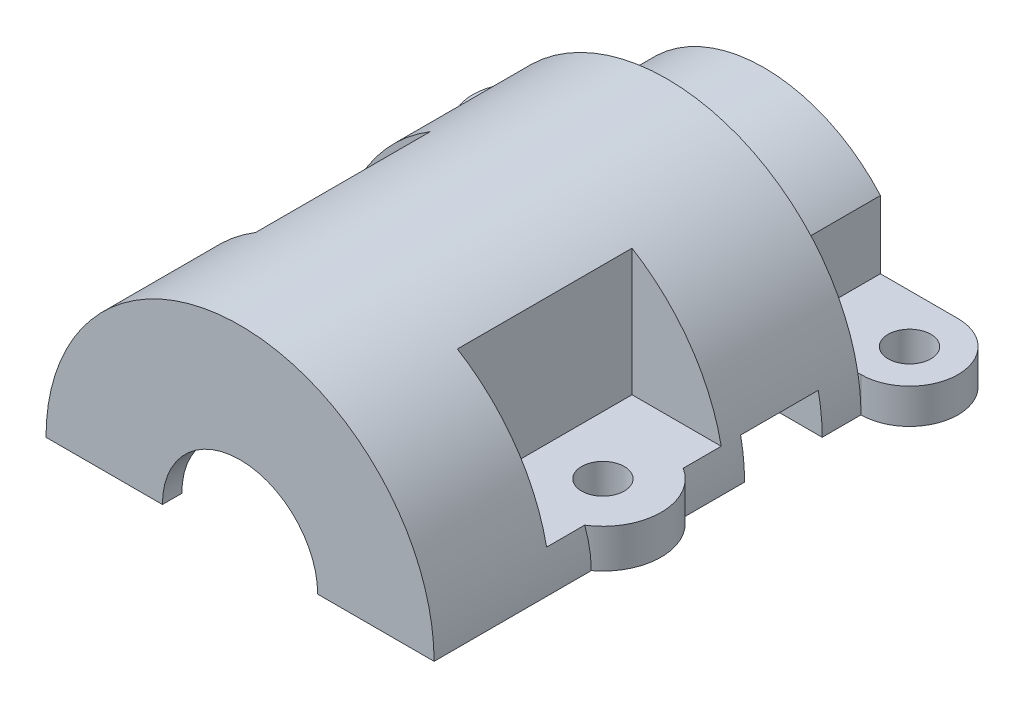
ISO-10303-21;
HEADER;
FILE_DESCRIPTION(('STEP AP214'),'2;1');
FILE_NAME('part.step','',(''),(''),'','','');
FILE_SCHEMA(('AUTOMOTIVE_DESIGN { 1 0 10303 214 1 1 1 1 }'));
ENDSEC;
DATA;
#1=APPLICATION_CONTEXT('core data for automotive mechanical design processes');
#2=APPLICATION_PROTOCOL_DEFINITION('international standard','automotive_design',2000,#1);
#3=PRODUCT_CONTEXT('',#1,'mechanical');
#4=PRODUCT('Part','Part','',(#3));
#5=PRODUCT_RELATED_PRODUCT_CATEGORY('part','',(#4));
#6=PRODUCT_DEFINITION_FORMATION('','',#4);
#7=PRODUCT_DEFINITION_CONTEXT('part definition',#1,'design');
#8=PRODUCT_DEFINITION('design','',#6,#7);
#9=PRODUCT_DEFINITION_SHAPE('','',#8);
#10=(LENGTH_UNIT() NAMED_UNIT(*) SI_UNIT(.MILLI.,.METRE.));
#11=(NAMED_UNIT(*) PLANE_ANGLE_UNIT() SI_UNIT($,.RADIAN.));
#12=(NAMED_UNIT(*) SI_UNIT($,.STERADIAN.) SOLID_ANGLE_UNIT());
#13=UNCERTAINTY_MEASURE_WITH_UNIT(LENGTH_MEASURE(1.E-05),#10,'distance_accuracy_value','');
#14=(GEOMETRIC_REPRESENTATION_CONTEXT(3) GLOBAL_UNCERTAINTY_ASSIGNED_CONTEXT((#13)) GLOBAL_UNIT_ASSIGNED_CONTEXT((#10,
#11,#12)) REPRESENTATION_CONTEXT('',''));
#15=CARTESIAN_POINT('',(0.,0.,0.));
#16=DIRECTION('',(0.,0.,1.));
#17=DIRECTION('',(1.,0.,0.));
#18=AXIS2_PLACEMENT_3D('',#15,#16,#17);
#19=CARTESIAN_POINT('',(10.1506446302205,-9.20534940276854,6.35));
#20=DIRECTION('',(0.,0.,1.));
#21=DIRECTION('',(1.,0.,0.));
#22=AXIS2_PLACEMENT_3D('',#19,#20,#21);
#23=PLANE('',#22);
#24=DIRECTION('',(0.,1.,0.));
#25=VECTOR('',#24,1.);
#26=CARTESIAN_POINT('',(12.7,-9.20534940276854,6.35));
#27=LINE('',#26,#25);
#28=CARTESIAN_POINT('',(12.7,0.,6.35));
#29=VERTEX_POINT('',#28);
#30=CARTESIAN_POINT('',(12.7,2.286,6.35));
#31=VERTEX_POINT('',#30);
#32=EDGE_CURVE('E398',#29,#31,#27,.T.);
#33=ORIENTED_EDGE('',*,*,#32,.T.);
#34=DIRECTION('',(1.,0.,0.));
#35=VECTOR('',#34,1.);
#36=CARTESIAN_POINT('',(7.62,2.286,6.35));
#37=LINE('',#36,#35);
#38=CARTESIAN_POINT('',(12.4925659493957,2.286,6.35));
#39=VERTEX_POINT('',#38);
#40=EDGE_CURVE('E59',#39,#31,#37,.T.);
#41=ORIENTED_EDGE('',*,*,#40,.F.);
#42=CARTESIAN_POINT('',(0.,0.,6.35));
#43=DIRECTION('',(0.,0.,1.));
#44=DIRECTION('',(1.,0.,0.));
#45=AXIS2_PLACEMENT_3D('',#42,#43,#44);
#46=CIRCLE('',#45,12.7);
#47=EDGE_CURVE('E397',#29,#39,#46,.T.);
#48=ORIENTED_EDGE('',*,*,#47,.F.);
#49=EDGE_LOOP('',(#33,#41,#48));
#50=FACE_BOUND('',#49,.T.);
#51=ADVANCED_FACE('F33',(#50),#23,.T.);
#52=CARTESIAN_POINT('',(12.7,-9.20534940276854,3.175));
#53=DIRECTION('',(0.,1.,0.));
#54=DIRECTION('',(-1.,0.,0.));
#55=AXIS2_PLACEMENT_3D('',#52,#53,#54);
#56=CYLINDRICAL_SURFACE('',#55,3.175);
#57=DIRECTION('',(0.,1.,0.));
#58=VECTOR('',#57,1.);
#59=CARTESIAN_POINT('',(12.7,-9.20534940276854,0.));
#60=LINE('',#59,#58);
#61=CARTESIAN_POINT('',(12.7,0.,0.));
#62=VERTEX_POINT('',#61);
#63=CARTESIAN_POINT('',(12.7,2.286,0.));
#64=VERTEX_POINT('',#63);
#65=EDGE_CURVE('E391',#62,#64,#60,.T.);
#66=ORIENTED_EDGE('',*,*,#65,.T.);
#67=CARTESIAN_POINT('',(12.7,2.286,3.175));
#68=DIRECTION('',(0.,1.,0.));
#69=DIRECTION('',(-1.,0.,0.));
#70=AXIS2_PLACEMENT_3D('',#67,#68,#69);
#71=CIRCLE('',#70,3.175);
#72=EDGE_CURVE('E308',#64,#31,#71,.F.);
#73=ORIENTED_EDGE('',*,*,#72,.T.);
#74=ORIENTED_EDGE('',*,*,#32,.F.);
#75=CARTESIAN_POINT('',(12.7,0.,3.175));
#76=DIRECTION('',(0.,1.,0.));
#77=DIRECTION('',(0.,0.,1.));
#78=AXIS2_PLACEMENT_3D('',#75,#76,#77);
#79=CIRCLE('',#78,3.175);
#80=EDGE_CURVE('E394',#62,#29,#79,.F.);
#81=ORIENTED_EDGE('',*,*,#80,.F.);
#82=EDGE_LOOP('',(#66,#73,#74,#81));
#83=FACE_BOUND('',#82,.T.);
#84=ADVANCED_FACE('F607',(#83),#56,.T.);
#85=CARTESIAN_POINT('',(12.7,0.,3.175));
#86=DIRECTION('',(0.,1.,0.));
#87=DIRECTION('',(-1.,0.,0.));
#88=AXIS2_PLACEMENT_3D('',#85,#86,#87);
#89=CYLINDRICAL_SURFACE('',#88,1.397);
#90=CARTESIAN_POINT('',(12.7,0.,3.175));
#91=DIRECTION('',(0.,1.,0.));
#92=DIRECTION('',(-1.,0.,0.));
#93=AXIS2_PLACEMENT_3D('',#90,#91,#92);
#94=CIRCLE('',#93,1.397);
#95=CARTESIAN_POINT('',(11.303,0.,3.175));
#96=VERTEX_POINT('',#95);
#97=EDGE_CURVE('E387',#96,#96,#94,.T.);
#98=ORIENTED_EDGE('',*,*,#97,.F.);
#99=EDGE_LOOP('',(#98));
#100=FACE_BOUND('',#99,.T.);
#101=CARTESIAN_POINT('',(12.7,2.286,3.175));
#102=DIRECTION('',(0.,1.,0.));
#103=DIRECTION('',(-1.,0.,0.));
#104=AXIS2_PLACEMENT_3D('',#101,#102,#103);
#105=CIRCLE('',#104,1.397);
#106=CARTESIAN_POINT('',(11.303,2.286,3.175));
#107=VERTEX_POINT('',#106);
#108=EDGE_CURVE('E38',#107,#107,#105,.F.);
#109=ORIENTED_EDGE('',*,*,#108,.F.);
#110=EDGE_LOOP('',(#109));
#111=FACE_BOUND('',#110,.T.);
#112=ADVANCED_FACE('F614',(#100,#111),#89,.F.);
#113=CARTESIAN_POINT('',(0.,0.,34.29));
#114=DIRECTION('',(0.,0.,-1.));
#115=DIRECTION('',(-1.,0.,0.));
#116=AXIS2_PLACEMENT_3D('',#113,#114,#115);
#117=CYLINDRICAL_SURFACE('',#116,12.7);
#118=CARTESIAN_POINT('',(0.,0.,15.24));
#119=DIRECTION('',(0.,0.,-1.));
#120=DIRECTION('',(-1.,0.,0.));
#121=AXIS2_PLACEMENT_3D('',#118,#119,#120);
#122=CIRCLE('',#121,12.7);
#123=CARTESIAN_POINT('',(-12.4434078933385,2.54,15.24));
#124=VERTEX_POINT('',#123);
#125=CARTESIAN_POINT('',(-6.604,10.8479115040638,15.24));
#126=VERTEX_POINT('',#125);
#127=EDGE_CURVE('E582',#124,#126,#122,.T.);
#128=ORIENTED_EDGE('',*,*,#127,.T.);
#129=DIRECTION('',(0.,0.,-1.));
#130=VECTOR('',#129,1.);
#131=CARTESIAN_POINT('',(-6.604,10.8479115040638,34.29));
#132=LINE('',#131,#130);
#133=CARTESIAN_POINT('',(-6.604,10.8479115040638,26.67));
#134=VERTEX_POINT('',#133);
#135=EDGE_CURVE('E11',#134,#126,#132,.T.);
#136=ORIENTED_EDGE('',*,*,#135,.F.);
#137=CARTESIAN_POINT('',(0.,0.,26.67));
#138=DIRECTION('',(0.,0.,1.));
#139=DIRECTION('',(1.,0.,0.));
#140=AXIS2_PLACEMENT_3D('',#137,#138,#139);
#141=CIRCLE('',#140,12.7);
#142=CARTESIAN_POINT('',(-12.4434078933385,2.54,26.67));
#143=VERTEX_POINT('',#142);
#144=EDGE_CURVE('E584',#134,#143,#141,.T.);
#145=ORIENTED_EDGE('',*,*,#144,.T.);
#146=DIRECTION('',(0.,0.,-1.));
#147=VECTOR('',#146,1.);
#148=CARTESIAN_POINT('',(-12.4434078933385,2.54,34.29));
#149=LINE('',#148,#147);
#150=CARTESIAN_POINT('',(-12.4434078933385,2.54,24.179531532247));
#151=VERTEX_POINT('',#150);
#152=EDGE_CURVE('E580',#143,#151,#149,.T.);
#153=ORIENTED_EDGE('',*,*,#152,.T.);
#154=CARTESIAN_POINT('',(-7.62,10.16,23.5453019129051));
#155=CARTESIAN_POINT('',(-7.69752918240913,10.1018748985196,23.6289514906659));
#156=CARTESIAN_POINT('',(-7.77761698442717,10.0404026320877,23.7077847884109));
#157=CARTESIAN_POINT('',(-7.941412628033,9.91134186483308,23.8557823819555));
#158=CARTESIAN_POINT('',(-8.02511456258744,9.84376316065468,23.9249617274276));
#159=CARTESIAN_POINT('',(-8.19397191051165,9.70364676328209,24.0531777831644));
#160=CARTESIAN_POINT('',(-8.2791016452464,9.6311709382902,24.1123165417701));
#161=CARTESIAN_POINT('',(-8.45057743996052,9.48107219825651,24.2217137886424));
#162=CARTESIAN_POINT('',(-8.53692406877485,9.4034468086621,24.271967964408));
#163=CARTESIAN_POINT('',(-8.73362040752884,9.22151855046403,24.3766994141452));
#164=CARTESIAN_POINT('',(-8.84403216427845,9.11575582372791,24.4285287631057));
#165=CARTESIAN_POINT('',(-9.06346710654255,8.89761337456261,24.519587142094));
#166=CARTESIAN_POINT('',(-9.1724900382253,8.7852324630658,24.5588138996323));
#167=CARTESIAN_POINT('',(-9.38829122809,8.55424270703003,24.6260826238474));
#168=CARTESIAN_POINT('',(-9.49505864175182,8.43561054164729,24.6540787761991));
#169=CARTESIAN_POINT('',(-9.70495640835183,8.19326260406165,24.6999836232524));
#170=CARTESIAN_POINT('',(-9.8080854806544,8.06954507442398,24.7178887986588));
#171=CARTESIAN_POINT('',(-10.0623332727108,7.75238313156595,24.7518887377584));
#172=CARTESIAN_POINT('',(-10.2106173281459,7.55603772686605,24.7622339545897));
#173=CARTESIAN_POINT('',(-10.4955989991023,7.15493115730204,24.76679280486));
#174=CARTESIAN_POINT('',(-10.6322904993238,6.95016563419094,24.7609979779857));
#175=CARTESIAN_POINT('',(-10.8935325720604,6.53311814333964,24.7369821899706));
#176=CARTESIAN_POINT('',(-11.0180539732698,6.32081970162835,24.7187321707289));
#177=CARTESIAN_POINT('',(-11.2541624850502,5.89017428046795,24.6731552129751));
#178=CARTESIAN_POINT('',(-11.3657503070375,5.67182763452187,24.6458287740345));
#179=CARTESIAN_POINT('',(-11.6243550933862,5.1276087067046,24.5711718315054));
#180=CARTESIAN_POINT('',(-11.7639317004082,4.79865165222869,24.5204314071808));
#181=CARTESIAN_POINT('',(-12.0147950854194,4.13063457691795,24.4150658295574));
#182=CARTESIAN_POINT('',(-12.1260675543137,3.79156954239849,24.3604387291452));
#183=CARTESIAN_POINT('',(-12.3195836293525,3.1055414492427,24.2560506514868));
#184=CARTESIAN_POINT('',(-12.4019146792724,2.75860561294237,24.2062753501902));
#185=CARTESIAN_POINT('',(-12.5034424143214,2.23288902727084,24.1412092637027));
#186=CARTESIAN_POINT('',(-12.5336233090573,2.05676665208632,24.1211202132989));
#187=CARTESIAN_POINT('',(-12.5865702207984,1.70300422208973,24.0850273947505));
#188=CARTESIAN_POINT('',(-12.6093373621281,1.52536440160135,24.0690230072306));
#189=CARTESIAN_POINT('',(-12.6471803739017,1.17061682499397,24.0419955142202));
#190=CARTESIAN_POINT('',(-12.6623277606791,0.9935202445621,24.0309262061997));
#191=CARTESIAN_POINT('',(-12.6851811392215,0.638592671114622,24.0140912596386));
#192=CARTESIAN_POINT('',(-12.6928872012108,0.460761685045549,24.0083255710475));
#193=CARTESIAN_POINT('',(-12.7008145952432,0.104843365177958,24.0023930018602));
#194=CARTESIAN_POINT('',(-12.7010361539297,-0.0732439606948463,24.0022259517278));
#195=CARTESIAN_POINT('',(-12.6939941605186,-0.429185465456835,24.0074981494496));
#196=CARTESIAN_POINT('',(-12.6867305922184,-0.607039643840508,24.0129374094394));
#197=CARTESIAN_POINT('',(-12.6647283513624,-0.962523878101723,24.0291681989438));
#198=CARTESIAN_POINT('',(-12.6499694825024,-1.1401520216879,24.0399741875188));
#199=CARTESIAN_POINT('',(-12.6130418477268,-1.49428502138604,24.066401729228));
#200=CARTESIAN_POINT('',(-12.5908719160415,-1.67078969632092,24.0820240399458));
#201=CARTESIAN_POINT('',(-12.5133796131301,-2.19806576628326,24.1350442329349));
#202=CARTESIAN_POINT('',(-12.4470703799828,-2.54666879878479,24.1785990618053));
#203=CARTESIAN_POINT('',(-12.2983842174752,-3.18267780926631,24.2673155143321));
#204=CARTESIAN_POINT('',(-12.2200557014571,-3.47123889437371,24.3111961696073));
#205=CARTESIAN_POINT('',(-12.0433427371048,-4.04191598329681,24.4004534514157));
#206=CARTESIAN_POINT('',(-11.9449595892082,-4.32403240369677,24.4458299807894));
#207=CARTESIAN_POINT('',(-11.7287544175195,-4.88005725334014,24.5328553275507));
#208=CARTESIAN_POINT('',(-11.6110079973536,-5.15399289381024,24.5745177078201));
#209=CARTESIAN_POINT('',(-11.3560492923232,-5.69378473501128,24.6490883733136));
#210=CARTESIAN_POINT('',(-11.218845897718,-5.95964455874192,24.6820006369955));
#211=CARTESIAN_POINT('',(-10.9361805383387,-6.46272678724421,24.731566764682));
#212=CARTESIAN_POINT('',(-10.7920904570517,-6.70060895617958,24.7492472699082));
#213=CARTESIAN_POINT('',(-10.5640059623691,-7.05062174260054,24.7628101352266));
#214=CARTESIAN_POINT('',(-10.4858521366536,-7.16633649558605,24.7651648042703));
#215=CARTESIAN_POINT('',(-10.3257347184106,-7.39518308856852,24.7648175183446));
#216=CARTESIAN_POINT('',(-10.2437690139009,-7.50831344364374,24.76211272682));
#217=CARTESIAN_POINT('',(-10.16,-7.62,24.7565239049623));
#218=B_SPLINE_CURVE_WITH_KNOTS('',3,(#154,#155,#156,#157,#158,#159,#160,#161,#162,#163,#164,
#165,#166,#167,#168,#169,#170,#171,#172,#173,#174,#175,#176,#177,#178,#179,#180,#181,#182,#183,
#184,#185,#186,#187,#188,#189,#190,#191,#192,#193,#194,#195,#196,#197,#198,#199,#200,#201,#202,
#203,#204,#205,#206,#207,#208,#209,#210,#211,#212,#213,#214,#215,#216,#217),.UNSPECIFIED.,.F.,
.F.,(4,2,2,2,2,2,2,2,2,2,2,2,2,2,2,2,2,2,2,2,2,2,2,2,2,2,2,2,2,2,2,4),(0.,0.38375940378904,
0.766913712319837,1.14590437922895,1.52507850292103,2.00866797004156,2.49234458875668,
2.97797473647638,3.46377414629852,4.20139333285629,4.93939923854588,5.67913283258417,
6.41882571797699,7.50015690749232,8.58203367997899,9.66061298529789,10.1998908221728,
10.7390868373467,11.2731230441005,11.8071542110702,12.3411692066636,12.8751853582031,
13.4106481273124,13.9461951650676,15.0170806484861,15.923008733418,16.8288780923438,
17.7312910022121,18.6332929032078,19.4682495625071,19.8870645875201,20.3061144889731),.UNSPECIFIED.);
#219=CARTESIAN_POINT('',(-12.7,0.,24.003));
#220=VERTEX_POINT('',#219);
#221=EDGE_CURVE('E376',#151,#220,#218,.T.);
#222=ORIENTED_EDGE('',*,*,#221,.T.);
#223=DIRECTION('',(0.,0.,1.));
#224=VECTOR('',#223,1.);
#225=CARTESIAN_POINT('',(-12.7,0.,0.));
#226=LINE('',#225,#224);
#227=CARTESIAN_POINT('',(-12.7,0.,34.29));
#228=VERTEX_POINT('',#227);
#229=EDGE_CURVE('E531',#220,#228,#226,.T.);
#230=ORIENTED_EDGE('',*,*,#229,.T.);
#231=CARTESIAN_POINT('',(0.,0.,34.29));
#232=DIRECTION('',(0.,0.,1.));
#233=DIRECTION('',(1.,0.,0.));
#234=AXIS2_PLACEMENT_3D('',#231,#232,#233);
#235=CIRCLE('',#234,12.7);
#236=CARTESIAN_POINT('',(12.7,0.,34.29));
#237=VERTEX_POINT('',#236);
#238=EDGE_CURVE('E529',#237,#228,#235,.T.);
#239=ORIENTED_EDGE('',*,*,#238,.F.);
#240=DIRECTION('',(0.,0.,1.));
#241=VECTOR('',#240,1.);
#242=CARTESIAN_POINT('',(12.7,0.,0.));
#243=LINE('',#242,#241);
#244=CARTESIAN_POINT('',(12.7,0.,24.003));
#245=VERTEX_POINT('',#244);
#246=EDGE_CURVE('E522',#245,#237,#243,.T.);
#247=ORIENTED_EDGE('',*,*,#246,.F.);
#248=CARTESIAN_POINT('',(10.16,-7.62,24.7565239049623));
#249=CARTESIAN_POINT('',(10.2388985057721,-7.51480625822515,24.7617890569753));
#250=CARTESIAN_POINT('',(10.3161993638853,-7.40833008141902,24.764494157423));
#251=CARTESIAN_POINT('',(10.4674402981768,-7.19305075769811,24.7653767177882));
#252=CARTESIAN_POINT('',(10.5413815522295,-7.0842484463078,24.763555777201));
#253=CARTESIAN_POINT('',(10.7576953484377,-6.75505935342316,24.7522104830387));
#254=CARTESIAN_POINT('',(10.894891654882,-6.53144526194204,24.7368208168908));
#255=CARTESIAN_POINT('',(11.1549786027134,-6.07661652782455,24.6945775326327));
#256=CARTESIAN_POINT('',(11.2778405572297,-5.8453877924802,24.6677014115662));
#257=CARTESIAN_POINT('',(11.5087649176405,-5.37649310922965,24.6062828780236));
#258=CARTESIAN_POINT('',(11.6168173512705,-5.13882295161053,24.5717353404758));
#259=CARTESIAN_POINT('',(11.8524863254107,-4.57507583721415,24.4859406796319));
#260=CARTESIAN_POINT('',(11.9740487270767,-4.24670872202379,24.4330368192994));
#261=CARTESIAN_POINT('',(12.1897231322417,-3.58094287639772,24.3280233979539));
#262=CARTESIAN_POINT('',(12.2838311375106,-3.24354283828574,24.2759139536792));
#263=CARTESIAN_POINT('',(12.4438084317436,-2.56195830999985,24.1806279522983));
#264=CARTESIAN_POINT('',(12.5097722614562,-2.21780066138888,24.1374217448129));
#265=CARTESIAN_POINT('',(12.587297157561,-1.69727659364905,24.0845097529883));
#266=CARTESIAN_POINT('',(12.6095686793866,-1.52305349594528,24.0688552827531));
#267=CARTESIAN_POINT('',(12.6468890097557,-1.17348966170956,24.0422061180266));
#268=CARTESIAN_POINT('',(12.6619388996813,-0.99814909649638,24.0312107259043));
#269=CARTESIAN_POINT('',(12.6845514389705,-0.649708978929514,24.0145569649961));
#270=CARTESIAN_POINT('',(12.6922360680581,-0.476621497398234,24.0088117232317));
#271=CARTESIAN_POINT('',(12.7005146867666,-0.130180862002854,24.0026184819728));
#272=CARTESIAN_POINT('',(12.7011087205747,0.0431722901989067,24.0021704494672));
#273=CARTESIAN_POINT('',(12.6952023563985,0.389706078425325,24.0065944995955));
#274=CARTESIAN_POINT('',(12.6887012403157,0.562886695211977,24.0114671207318));
#275=CARTESIAN_POINT('',(12.6686384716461,0.908616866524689,24.0262960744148));
#276=CARTESIAN_POINT('',(12.6550767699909,1.08116641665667,24.0362524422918));
#277=CARTESIAN_POINT('',(12.6208963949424,1.42585989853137,24.0608256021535));
#278=CARTESIAN_POINT('',(12.6002524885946,1.59800013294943,24.0754590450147));
#279=CARTESIAN_POINT('',(12.5520043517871,1.94092284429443,24.1087104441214));
#280=CARTESIAN_POINT('',(12.524399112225,2.11170512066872,24.1273289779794));
#281=CARTESIAN_POINT('',(12.4312795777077,2.62157098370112,24.1879871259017));
#282=CARTESIAN_POINT('',(12.3554532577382,2.95825583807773,24.2348358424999));
#283=CARTESIAN_POINT('',(12.1872576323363,3.5852059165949,24.3283941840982));
#284=CARTESIAN_POINT('',(12.0977931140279,3.87635716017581,24.3745003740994));
#285=CARTESIAN_POINT('',(11.8981288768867,4.45165147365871,24.4657716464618));
#286=CARTESIAN_POINT('',(11.7879289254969,4.73579446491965,24.5109367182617));
#287=CARTESIAN_POINT('',(11.5473364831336,5.29542624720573,24.5947578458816));
#288=CARTESIAN_POINT('',(11.4170028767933,5.57093754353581,24.6334322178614));
#289=CARTESIAN_POINT('',(11.1361953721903,6.11295088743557,24.6987029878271));
#290=CARTESIAN_POINT('',(10.9857322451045,6.37945765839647,24.7253058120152));
#291=CARTESIAN_POINT('',(10.7305585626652,6.7954507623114,24.7530267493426));
#292=CARTESIAN_POINT('',(10.6321447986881,6.94842561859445,24.7601101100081));
#293=CARTESIAN_POINT('',(10.4287601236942,7.25010542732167,24.7663296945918));
#294=CARTESIAN_POINT('',(10.3237908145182,7.39881140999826,24.7654678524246));
#295=CARTESIAN_POINT('',(10.1076902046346,7.691403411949,24.7542084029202));
#296=CARTESIAN_POINT('',(9.99655702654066,7.8352879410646,24.7438078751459));
#297=CARTESIAN_POINT('',(9.76885606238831,8.11740604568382,24.7117410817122));
#298=CARTESIAN_POINT('',(9.65228938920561,8.25564076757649,24.6900771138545));
#299=CARTESIAN_POINT('',(9.43788532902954,8.49925244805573,24.639149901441));
#300=CARTESIAN_POINT('',(9.34081870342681,8.60578775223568,24.6121865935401));
#301=CARTESIAN_POINT('',(9.14460645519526,8.81400147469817,24.548795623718));
#302=CARTESIAN_POINT('',(9.04546137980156,8.91568114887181,24.5123704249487));
#303=CARTESIAN_POINT('',(8.84637925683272,9.11324114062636,24.4292274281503));
#304=CARTESIAN_POINT('',(8.74644592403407,9.20913956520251,24.3825441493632));
#305=CARTESIAN_POINT('',(8.54676564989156,9.39475339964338,24.2779869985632));
#306=CARTESIAN_POINT('',(8.44701865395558,9.4844710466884,24.2201172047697));
#307=CARTESIAN_POINT('',(8.22175387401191,9.68094831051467,24.0747295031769));
#308=CARTESIAN_POINT('',(8.09673400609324,9.78556351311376,23.9834379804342));
#309=CARTESIAN_POINT('',(7.91386653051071,9.93312359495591,23.8310718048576));
#310=CARTESIAN_POINT('',(7.85351898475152,9.98087502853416,23.7775330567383));
#311=CARTESIAN_POINT('',(7.73499071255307,10.0730115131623,23.6652909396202));
#312=CARTESIAN_POINT('',(7.67681165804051,10.1173939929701,23.6065836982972));
#313=CARTESIAN_POINT('',(7.62,10.16,23.5453019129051));
#314=B_SPLINE_CURVE_WITH_KNOTS('',3,(#248,#249,#250,#251,#252,#253,#254,#255,#256,#257,#258,
#259,#260,#261,#262,#263,#264,#265,#266,#267,#268,#269,#270,#271,#272,#273,#274,#275,#276,#277,
#278,#279,#280,#281,#282,#283,#284,#285,#286,#287,#288,#289,#290,#291,#292,#293,#294,#295,#296,
#297,#298,#299,#300,#301,#302,#303,#304,#305,#306,#307,#308,#309,#310,#311,#312,#313),
.UNSPECIFIED.,.F.,.F.,(4,2,2,2,2,2,2,2,2,2,2,2,2,2,2,2,2,2,2,2,2,2,2,2,2,2,2,2,2,2,2,2,4),(0.,
0.394700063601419,0.78926066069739,1.57671799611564,2.3657251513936,3.15526101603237,
4.2163640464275,5.27762152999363,6.33528546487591,6.86412028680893,7.39287589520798,
7.91271494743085,8.43255076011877,8.95243919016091,9.4723312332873,9.9940951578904,
10.5159347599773,11.5593661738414,12.4828170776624,13.4062783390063,14.3270881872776,
15.2474072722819,15.7932282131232,16.3389163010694,16.8847715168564,17.4305154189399,
17.8700330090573,18.3094362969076,18.7473830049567,19.1851703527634,19.7439709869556,
20.0250120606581,20.30626551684),.UNSPECIFIED.);
#315=CARTESIAN_POINT('',(12.4434078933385,2.54,24.179531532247));
#316=VERTEX_POINT('',#315);
#317=EDGE_CURVE('E352',#245,#316,#314,.T.);
#318=ORIENTED_EDGE('',*,*,#317,.T.);
#319=DIRECTION('',(0.,0.,-1.));
#320=VECTOR('',#319,1.);
#321=CARTESIAN_POINT('',(12.4434078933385,2.54,34.29));
#322=LINE('',#321,#320);
#323=CARTESIAN_POINT('',(12.4434078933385,2.54,26.67));
#324=VERTEX_POINT('',#323);
#325=EDGE_CURVE('E572',#324,#316,#322,.T.);
#326=ORIENTED_EDGE('',*,*,#325,.F.);
#327=CARTESIAN_POINT('',(0.,0.,26.67));
#328=DIRECTION('',(0.,0.,1.));
#329=DIRECTION('',(1.,0.,0.));
#330=AXIS2_PLACEMENT_3D('',#327,#328,#329);
#331=CIRCLE('',#330,12.7);
#332=CARTESIAN_POINT('',(6.604,10.8479115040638,26.67));
#333=VERTEX_POINT('',#332);
#334=EDGE_CURVE('E575',#324,#333,#331,.T.);
#335=ORIENTED_EDGE('',*,*,#334,.T.);
#336=DIRECTION('',(0.,0.,-1.));
#337=VECTOR('',#336,1.);
#338=CARTESIAN_POINT('',(6.604,10.8479115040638,34.29));
#339=LINE('',#338,#337);
#340=CARTESIAN_POINT('',(6.604,10.8479115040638,15.24));
#341=VERTEX_POINT('',#340);
#342=EDGE_CURVE('E43',#341,#333,#339,.F.);
#343=ORIENTED_EDGE('',*,*,#342,.F.);
#344=CARTESIAN_POINT('',(0.,0.,15.24));
#345=DIRECTION('',(0.,0.,-1.));
#346=DIRECTION('',(-1.,0.,0.));
#347=AXIS2_PLACEMENT_3D('',#344,#345,#346);
#348=CIRCLE('',#347,12.7);
#349=CARTESIAN_POINT('',(12.4434078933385,2.54,15.24));
#350=VERTEX_POINT('',#349);
#351=EDGE_CURVE('E577',#341,#350,#348,.T.);
#352=ORIENTED_EDGE('',*,*,#351,.T.);
#353=CARTESIAN_POINT('',(12.4434078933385,2.54,17.730468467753));
#354=VERTEX_POINT('',#353);
#355=EDGE_CURVE('E571',#354,#350,#322,.T.);
#356=ORIENTED_EDGE('',*,*,#355,.F.);
#357=CARTESIAN_POINT('',(7.62,10.16,18.3646980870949));
#358=CARTESIAN_POINT('',(7.69752918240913,10.1018748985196,18.2810485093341));
#359=CARTESIAN_POINT('',(7.77761698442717,10.0404026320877,18.2022152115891));
#360=CARTESIAN_POINT('',(7.941412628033,9.91134186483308,18.0542176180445));
#361=CARTESIAN_POINT('',(8.02511456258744,9.84376316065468,17.9850382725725));
#362=CARTESIAN_POINT('',(8.19397191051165,9.70364676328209,17.8568222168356));
#363=CARTESIAN_POINT('',(8.2791016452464,9.6311709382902,17.7976834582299));
#364=CARTESIAN_POINT('',(8.45057743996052,9.48107219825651,17.6882862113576));
#365=CARTESIAN_POINT('',(8.53692406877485,9.4034468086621,17.6380320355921));
#366=CARTESIAN_POINT('',(8.73362040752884,9.22151855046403,17.5333005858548));
#367=CARTESIAN_POINT('',(8.84403216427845,9.11575582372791,17.4814712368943));
#368=CARTESIAN_POINT('',(9.06346710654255,8.89761337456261,17.390412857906));
#369=CARTESIAN_POINT('',(9.1724900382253,8.78523246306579,17.3511861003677));
#370=CARTESIAN_POINT('',(9.38829122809,8.55424270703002,17.2839173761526));
#371=CARTESIAN_POINT('',(9.49505864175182,8.43561054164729,17.2559212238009));
#372=CARTESIAN_POINT('',(9.70495640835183,8.19326260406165,17.2100163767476));
#373=CARTESIAN_POINT('',(9.8080854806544,8.06954507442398,17.1921112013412));
#374=CARTESIAN_POINT('',(10.0623332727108,7.75238313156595,17.1581112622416));
#375=CARTESIAN_POINT('',(10.2106173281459,7.55603772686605,17.1477660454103));
#376=CARTESIAN_POINT('',(10.4955989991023,7.15493115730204,17.1432071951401));
#377=CARTESIAN_POINT('',(10.6322904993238,6.95016563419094,17.1490020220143));
#378=CARTESIAN_POINT('',(10.8935325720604,6.53311814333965,17.1730178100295));
#379=CARTESIAN_POINT('',(11.0180539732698,6.32081970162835,17.1912678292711));
#380=CARTESIAN_POINT('',(11.2541624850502,5.89017428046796,17.2368447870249));
#381=CARTESIAN_POINT('',(11.3657503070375,5.67182763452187,17.2641712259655));
#382=CARTESIAN_POINT('',(11.6243550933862,5.1276087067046,17.3388281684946));
#383=CARTESIAN_POINT('',(11.7639317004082,4.79865165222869,17.3895685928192));
#384=CARTESIAN_POINT('',(12.0147950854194,4.13063457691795,17.4949341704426));
#385=CARTESIAN_POINT('',(12.1260675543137,3.79156954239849,17.5495612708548));
#386=CARTESIAN_POINT('',(12.3195836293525,3.1055414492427,17.6539493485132));
#387=CARTESIAN_POINT('',(12.4019146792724,2.75860561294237,17.7037246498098));
#388=CARTESIAN_POINT('',(12.5034424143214,2.23288902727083,17.7687907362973));
#389=CARTESIAN_POINT('',(12.5336233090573,2.05676665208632,17.7888797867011));
#390=CARTESIAN_POINT('',(12.5865702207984,1.70300422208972,17.8249726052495));
#391=CARTESIAN_POINT('',(12.6093373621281,1.52536440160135,17.8409769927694));
#392=CARTESIAN_POINT('',(12.6471803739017,1.17061682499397,17.8680044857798));
#393=CARTESIAN_POINT('',(12.6623277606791,0.993520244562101,17.8790737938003));
#394=CARTESIAN_POINT('',(12.6851811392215,0.638592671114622,17.8959087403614));
#395=CARTESIAN_POINT('',(12.6928872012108,0.46076168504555,17.9016744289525));
#396=CARTESIAN_POINT('',(12.7008145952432,0.104843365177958,17.9076069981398));
#397=CARTESIAN_POINT('',(12.7010361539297,-0.0732439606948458,17.9077740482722));
#398=CARTESIAN_POINT('',(12.6939941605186,-0.429185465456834,17.9025018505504));
#399=CARTESIAN_POINT('',(12.6867305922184,-0.607039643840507,17.8970625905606));
#400=CARTESIAN_POINT('',(12.6647283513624,-0.962523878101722,17.8808318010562));
#401=CARTESIAN_POINT('',(12.6499694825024,-1.1401520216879,17.8700258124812));
#402=CARTESIAN_POINT('',(12.6130418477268,-1.49428502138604,17.843598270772));
#403=CARTESIAN_POINT('',(12.5908719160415,-1.67078969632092,17.8279759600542));
#404=CARTESIAN_POINT('',(12.5133796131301,-2.19806576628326,17.7749557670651));
#405=CARTESIAN_POINT('',(12.4470703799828,-2.54666879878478,17.7314009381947));
#406=CARTESIAN_POINT('',(12.2983842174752,-3.18267780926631,17.6426844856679));
#407=CARTESIAN_POINT('',(12.2200557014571,-3.47123889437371,17.5988038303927));
#408=CARTESIAN_POINT('',(12.0433427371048,-4.04191598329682,17.5095465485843));
#409=CARTESIAN_POINT('',(11.9449595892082,-4.32403240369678,17.4641700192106));
#410=CARTESIAN_POINT('',(11.7287544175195,-4.88005725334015,17.3771446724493));
#411=CARTESIAN_POINT('',(11.6110079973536,-5.15399289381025,17.3354822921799));
#412=CARTESIAN_POINT('',(11.3560492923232,-5.69378473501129,17.2609116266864));
#413=CARTESIAN_POINT('',(11.218845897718,-5.95964455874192,17.2279993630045));
#414=CARTESIAN_POINT('',(10.9361805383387,-6.46272678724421,17.178433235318));
#415=CARTESIAN_POINT('',(10.7920904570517,-6.70060895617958,17.1607527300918));
#416=CARTESIAN_POINT('',(10.5640059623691,-7.05062174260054,17.1471898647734));
#417=CARTESIAN_POINT('',(10.4858521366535,-7.16633649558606,17.1448351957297));
#418=CARTESIAN_POINT('',(10.3257347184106,-7.39518308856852,17.1451824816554));
#419=CARTESIAN_POINT('',(10.2437690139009,-7.50831344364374,17.14788727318));
#420=CARTESIAN_POINT('',(10.16,-7.62,17.1534760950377));
#421=B_SPLINE_CURVE_WITH_KNOTS('',3,(#357,#358,#359,#360,#361,#362,#363,#364,#365,#366,#367,
#368,#369,#370,#371,#372,#373,#374,#375,#376,#377,#378,#379,#380,#381,#382,#383,#384,#385,#386,
#387,#388,#389,#390,#391,#392,#393,#394,#395,#396,#397,#398,#399,#400,#401,#402,#403,#404,#405,
#406,#407,#408,#409,#410,#411,#412,#413,#414,#415,#416,#417,#418,#419,#420),.UNSPECIFIED.,.F.,
.F.,(4,2,2,2,2,2,2,2,2,2,2,2,2,2,2,2,2,2,2,2,2,2,2,2,2,2,2,2,2,2,2,4),(0.,0.383759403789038,
0.766913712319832,1.14590437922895,1.52507850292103,2.00866797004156,2.49234458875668,
2.97797473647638,3.46377414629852,4.20139333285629,4.93939923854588,5.67913283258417,
6.41882571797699,7.50015690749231,8.58203367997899,9.66061298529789,10.1998908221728,
10.7390868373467,11.2731230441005,11.8071542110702,12.3411692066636,12.8751853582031,
13.4106481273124,13.9461951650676,15.0170806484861,15.923008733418,16.8288780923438,
17.7312910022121,18.6332929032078,19.4682495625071,19.8870645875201,20.3061144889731),.UNSPECIFIED.);
#422=CARTESIAN_POINT('',(12.7,0.,17.907));
#423=VERTEX_POINT('',#422);
#424=EDGE_CURVE('E345',#354,#423,#421,.T.);
#425=ORIENTED_EDGE('',*,*,#424,.T.);
#426=CARTESIAN_POINT('',(12.7,0.,13.97));
#427=VERTEX_POINT('',#426);
#428=EDGE_CURVE('E534',#427,#423,#243,.T.);
#429=ORIENTED_EDGE('',*,*,#428,.F.);
#430=CARTESIAN_POINT('',(0.,0.,13.97));
#431=DIRECTION('',(0.,0.,1.));
#432=DIRECTION('',(1.,0.,0.));
#433=AXIS2_PLACEMENT_3D('',#430,#431,#432);
#434=CIRCLE('',#433,12.7);
#435=CARTESIAN_POINT('',(12.4434078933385,2.54,13.97));
#436=VERTEX_POINT('',#435);
#437=EDGE_CURVE('E481',#427,#436,#434,.T.);
#438=ORIENTED_EDGE('',*,*,#437,.T.);
#439=DIRECTION('',(0.,0.,-1.));
#440=VECTOR('',#439,1.);
#441=CARTESIAN_POINT('',(12.4434078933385,2.54,34.29));
#442=LINE('',#441,#440);
#443=CARTESIAN_POINT('',(12.4434078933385,2.54,8.89));
#444=VERTEX_POINT('',#443);
#445=EDGE_CURVE('E475',#436,#444,#442,.T.);
#446=ORIENTED_EDGE('',*,*,#445,.T.);
#447=CARTESIAN_POINT('',(0.,0.,8.89));
#448=DIRECTION('',(0.,0.,-1.));
#449=DIRECTION('',(-1.,0.,0.));
#450=AXIS2_PLACEMENT_3D('',#447,#448,#449);
#451=CIRCLE('',#450,12.7);
#452=CARTESIAN_POINT('',(12.7,0.,8.89));
#453=VERTEX_POINT('',#452);
#454=EDGE_CURVE('E462',#444,#453,#451,.T.);
#455=ORIENTED_EDGE('',*,*,#454,.T.);
#456=EDGE_CURVE('E532',#29,#453,#243,.T.);
#457=ORIENTED_EDGE('',*,*,#456,.F.);
#458=ORIENTED_EDGE('',*,*,#47,.T.);
#459=CARTESIAN_POINT('',(0.,0.,6.35));
#460=DIRECTION('',(0.,0.,-1.));
#461=DIRECTION('',(-1.,0.,0.));
#462=AXIS2_PLACEMENT_3D('',#459,#460,#461);
#463=CIRCLE('',#462,12.7);
#464=CARTESIAN_POINT('',(-12.4925659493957,2.286,6.35));
#465=VERTEX_POINT('',#464);
#466=EDGE_CURVE('E287',#465,#39,#463,.T.);
#467=ORIENTED_EDGE('',*,*,#466,.F.);
#468=CARTESIAN_POINT('',(0.,0.,6.35));
#469=DIRECTION('',(0.,0.,1.));
#470=DIRECTION('',(1.,0.,0.));
#471=AXIS2_PLACEMENT_3D('',#468,#469,#470);
#472=CIRCLE('',#471,12.7);
#473=CARTESIAN_POINT('',(-12.7,0.,6.35));
#474=VERTEX_POINT('',#473);
#475=EDGE_CURVE('E409',#465,#474,#472,.T.);
#476=ORIENTED_EDGE('',*,*,#475,.T.);
#477=CARTESIAN_POINT('',(-12.7,0.,8.89));
#478=VERTEX_POINT('',#477);
#479=EDGE_CURVE('E527',#474,#478,#226,.T.);
#480=ORIENTED_EDGE('',*,*,#479,.T.);
#481=CARTESIAN_POINT('',(-12.4434078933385,2.54,8.89));
#482=VERTEX_POINT('',#481);
#483=EDGE_CURVE('E465',#478,#482,#451,.T.);
#484=ORIENTED_EDGE('',*,*,#483,.T.);
#485=DIRECTION('',(0.,0.,-1.));
#486=VECTOR('',#485,1.);
#487=CARTESIAN_POINT('',(-12.4434078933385,2.54,34.29));
#488=LINE('',#487,#486);
#489=CARTESIAN_POINT('',(-12.4434078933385,2.54,13.97));
#490=VERTEX_POINT('',#489);
#491=EDGE_CURVE('E472',#482,#490,#488,.F.);
#492=ORIENTED_EDGE('',*,*,#491,.T.);
#493=CARTESIAN_POINT('',(-12.7,0.,13.97));
#494=VERTEX_POINT('',#493);
#495=EDGE_CURVE('E478',#490,#494,#434,.T.);
#496=ORIENTED_EDGE('',*,*,#495,.T.);
#497=CARTESIAN_POINT('',(-12.7,0.,17.907));
#498=VERTEX_POINT('',#497);
#499=EDGE_CURVE('E530',#494,#498,#226,.T.);
#500=ORIENTED_EDGE('',*,*,#499,.T.);
#501=CARTESIAN_POINT('',(-10.16,-7.62,17.1534760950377));
#502=CARTESIAN_POINT('',(-10.2388985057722,-7.51480625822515,17.1482109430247));
#503=CARTESIAN_POINT('',(-10.3161993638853,-7.40833008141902,17.145505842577));
#504=CARTESIAN_POINT('',(-10.4674402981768,-7.19305075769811,17.1446232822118));
#505=CARTESIAN_POINT('',(-10.5413815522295,-7.0842484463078,17.146444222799));
#506=CARTESIAN_POINT('',(-10.7576953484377,-6.75505935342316,17.1577895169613));
#507=CARTESIAN_POINT('',(-10.894891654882,-6.53144526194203,17.1731791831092));
#508=CARTESIAN_POINT('',(-11.1549786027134,-6.07661652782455,17.2154224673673));
#509=CARTESIAN_POINT('',(-11.2778405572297,-5.8453877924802,17.2422985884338));
#510=CARTESIAN_POINT('',(-11.5087649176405,-5.37649310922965,17.3037171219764));
#511=CARTESIAN_POINT('',(-11.6168173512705,-5.13882295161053,17.3382646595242));
#512=CARTESIAN_POINT('',(-11.8524863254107,-4.57507583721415,17.4240593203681));
#513=CARTESIAN_POINT('',(-11.9740487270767,-4.24670872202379,17.4769631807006));
#514=CARTESIAN_POINT('',(-12.1897231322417,-3.58094287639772,17.5819766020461));
#515=CARTESIAN_POINT('',(-12.2838311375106,-3.24354283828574,17.6340860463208));
#516=CARTESIAN_POINT('',(-12.4438084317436,-2.56195830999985,17.7293720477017));
#517=CARTESIAN_POINT('',(-12.5097722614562,-2.21780066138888,17.7725782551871));
#518=CARTESIAN_POINT('',(-12.587297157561,-1.69727659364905,17.8254902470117));
#519=CARTESIAN_POINT('',(-12.6095686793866,-1.52305349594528,17.8411447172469));
#520=CARTESIAN_POINT('',(-12.6468890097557,-1.17348966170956,17.8677938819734));
#521=CARTESIAN_POINT('',(-12.6619388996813,-0.998149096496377,17.8787892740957));
#522=CARTESIAN_POINT('',(-12.6845514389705,-0.649708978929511,17.8954430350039));
#523=CARTESIAN_POINT('',(-12.6922360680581,-0.476621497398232,17.9011882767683));
#524=CARTESIAN_POINT('',(-12.7005146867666,-0.130180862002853,17.9073815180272));
#525=CARTESIAN_POINT('',(-12.7011087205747,0.0431722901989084,17.9078295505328));
#526=CARTESIAN_POINT('',(-12.6952023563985,0.389706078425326,17.9034055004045));
#527=CARTESIAN_POINT('',(-12.6887012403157,0.562886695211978,17.8985328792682));
#528=CARTESIAN_POINT('',(-12.6686384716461,0.90861686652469,17.8837039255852));
#529=CARTESIAN_POINT('',(-12.6550767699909,1.08116641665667,17.8737475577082));
#530=CARTESIAN_POINT('',(-12.6208963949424,1.42585989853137,17.8491743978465));
#531=CARTESIAN_POINT('',(-12.6002524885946,1.59800013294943,17.8345409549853));
#532=CARTESIAN_POINT('',(-12.5520043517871,1.94092284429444,17.8012895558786));
#533=CARTESIAN_POINT('',(-12.5243991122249,2.11170512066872,17.7826710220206));
#534=CARTESIAN_POINT('',(-12.4312795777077,2.62157098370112,17.7220128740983));
#535=CARTESIAN_POINT('',(-12.3554532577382,2.95825583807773,17.6751641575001));
#536=CARTESIAN_POINT('',(-12.1872576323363,3.5852059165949,17.5816058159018));
#537=CARTESIAN_POINT('',(-12.0977931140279,3.87635716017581,17.5354996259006));
#538=CARTESIAN_POINT('',(-11.8981288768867,4.45165147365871,17.4442283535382));
#539=CARTESIAN_POINT('',(-11.7879289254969,4.73579446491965,17.3990632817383));
#540=CARTESIAN_POINT('',(-11.5473364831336,5.29542624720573,17.3152421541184));
#541=CARTESIAN_POINT('',(-11.4170028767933,5.57093754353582,17.2765677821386));
#542=CARTESIAN_POINT('',(-11.1361953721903,6.11295088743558,17.2112970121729));
#543=CARTESIAN_POINT('',(-10.9857322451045,6.37945765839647,17.1846941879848));
#544=CARTESIAN_POINT('',(-10.7305585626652,6.79545076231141,17.1569732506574));
#545=CARTESIAN_POINT('',(-10.6321447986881,6.94842561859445,17.1498898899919));
#546=CARTESIAN_POINT('',(-10.4287601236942,7.25010542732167,17.1436703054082));
#547=CARTESIAN_POINT('',(-10.3237908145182,7.39881140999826,17.1445321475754));
#548=CARTESIAN_POINT('',(-10.1076902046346,7.69140341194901,17.1557915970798));
#549=CARTESIAN_POINT('',(-9.99655702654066,7.8352879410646,17.1661921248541));
#550=CARTESIAN_POINT('',(-9.76885606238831,8.11740604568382,17.1982589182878));
#551=CARTESIAN_POINT('',(-9.65228938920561,8.25564076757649,17.2199228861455));
#552=CARTESIAN_POINT('',(-9.43788532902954,8.49925244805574,17.270850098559));
#553=CARTESIAN_POINT('',(-9.34081870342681,8.60578775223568,17.2978134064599));
#554=CARTESIAN_POINT('',(-9.14460645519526,8.81400147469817,17.361204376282));
#555=CARTESIAN_POINT('',(-9.04546137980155,8.91568114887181,17.3976295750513));
#556=CARTESIAN_POINT('',(-8.84637925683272,9.11324114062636,17.4807725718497));
#557=CARTESIAN_POINT('',(-8.74644592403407,9.20913956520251,17.5274558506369));
#558=CARTESIAN_POINT('',(-8.54676564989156,9.39475339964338,17.6320130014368));
#559=CARTESIAN_POINT('',(-8.44701865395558,9.48447104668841,17.6898827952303));
#560=CARTESIAN_POINT('',(-8.22175387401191,9.68094831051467,17.8352704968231));
#561=CARTESIAN_POINT('',(-8.09673400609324,9.78556351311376,17.9265620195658));
#562=CARTESIAN_POINT('',(-7.91386653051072,9.93312359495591,18.0789281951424));
#563=CARTESIAN_POINT('',(-7.85351898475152,9.98087502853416,18.1324669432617));
#564=CARTESIAN_POINT('',(-7.73499071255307,10.0730115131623,18.2447090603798));
#565=CARTESIAN_POINT('',(-7.67681165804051,10.1173939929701,18.3034163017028));
#566=CARTESIAN_POINT('',(-7.62,10.16,18.3646980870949));
#567=B_SPLINE_CURVE_WITH_KNOTS('',3,(#501,#502,#503,#504,#505,#506,#507,#508,#509,#510,#511,
#512,#513,#514,#515,#516,#517,#518,#519,#520,#521,#522,#523,#524,#525,#526,#527,#528,#529,#530,
#531,#532,#533,#534,#535,#536,#537,#538,#539,#540,#541,#542,#543,#544,#545,#546,#547,#548,#549,
#550,#551,#552,#553,#554,#555,#556,#557,#558,#559,#560,#561,#562,#563,#564,#565,#566),
.UNSPECIFIED.,.F.,.F.,(4,2,2,2,2,2,2,2,2,2,2,2,2,2,2,2,2,2,2,2,2,2,2,2,2,2,2,2,2,2,2,2,4),(0.,
0.39470006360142,0.789260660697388,1.57671799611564,2.36572515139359,3.15526101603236,
4.2163640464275,5.27762152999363,6.33528546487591,6.86412028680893,7.39287589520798,
7.91271494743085,8.43255076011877,8.95243919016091,9.4723312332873,9.9940951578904,
10.5159347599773,11.5593661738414,12.4828170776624,13.4062783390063,14.3270881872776,
15.2474072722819,15.7932282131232,16.3389163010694,16.8847715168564,17.43051541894,
17.8700330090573,18.3094362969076,18.7473830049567,19.1851703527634,19.7439709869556,
20.0250120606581,20.30626551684),.UNSPECIFIED.);
#568=CARTESIAN_POINT('',(-12.4434078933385,2.54,17.730468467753));
#569=VERTEX_POINT('',#568);
#570=EDGE_CURVE('E382',#498,#569,#567,.T.);
#571=ORIENTED_EDGE('',*,*,#570,.T.);
#572=EDGE_CURVE('E579',#569,#124,#149,.T.);
#573=ORIENTED_EDGE('',*,*,#572,.T.);
#574=EDGE_LOOP('',(#128,#136,#145,#153,#222,#230,#239,#247,#318,#326,#335,#343,#352,#356,#425,
#429,#438,#446,#455,#457,#458,#467,#476,#480,#484,#492,#496,#500,#571,#573));
#575=FACE_BOUND('',#574,.T.);
#576=ADVANCED_FACE('F35',(#575),#117,.T.);
#577=CARTESIAN_POINT('',(-12.7,0.,0.));
#578=DIRECTION('',(0.,1.,0.));
#579=DIRECTION('',(0.,0.,1.));
#580=AXIS2_PLACEMENT_3D('',#577,#578,#579);
#581=PLANE('',#580);
#582=CARTESIAN_POINT('',(10.414,0.,20.955));
#583=DIRECTION('',(0.,1.,0.));
#584=DIRECTION('',(0.,0.,-1.));
#585=AXIS2_PLACEMENT_3D('',#582,#583,#584);
#586=CIRCLE('',#585,1.397);
#587=CARTESIAN_POINT('',(10.414,0.,19.558));
#588=VERTEX_POINT('',#587);
#589=EDGE_CURVE('E318',#588,#588,#586,.T.);
#590=ORIENTED_EDGE('',*,*,#589,.T.);
#591=EDGE_LOOP('',(#590));
#592=FACE_BOUND('',#591,.T.);
#593=ORIENTED_EDGE('',*,*,#428,.T.);
#594=CARTESIAN_POINT('',(10.414,0.,20.955));
#595=DIRECTION('',(0.,1.,0.));
#596=DIRECTION('',(0.,0.,1.));
#597=AXIS2_PLACEMENT_3D('',#594,#595,#596);
#598=CIRCLE('',#597,3.81);
#599=EDGE_CURVE('E343',#423,#245,#598,.F.);
#600=ORIENTED_EDGE('',*,*,#599,.T.);
#601=ORIENTED_EDGE('',*,*,#246,.T.);
#602=DIRECTION('',(-1.,0.,0.));
#603=VECTOR('',#602,1.);
#604=CARTESIAN_POINT('',(-12.7,0.,34.29));
#605=LINE('',#604,#603);
#606=CARTESIAN_POINT('',(5.08,0.,34.29));
#607=VERTEX_POINT('',#606);
#608=EDGE_CURVE('E524',#237,#607,#605,.T.);
#609=ORIENTED_EDGE('',*,*,#608,.T.);
#610=DIRECTION('',(0.,0.,-1.));
#611=VECTOR('',#610,1.);
#612=CARTESIAN_POINT('',(5.08,0.,-2.01673929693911));
#613=LINE('',#612,#611);
#614=CARTESIAN_POINT('',(5.08,0.,33.02));
#615=VERTEX_POINT('',#614);
#616=EDGE_CURVE('E568',#607,#615,#613,.T.);
#617=ORIENTED_EDGE('',*,*,#616,.T.);
#618=DIRECTION('',(1.,0.,0.));
#619=VECTOR('',#618,1.);
#620=CARTESIAN_POINT('',(-12.7,0.,33.02));
#621=LINE('',#620,#619);
#622=CARTESIAN_POINT('',(7.9375,0.,33.02));
#623=VERTEX_POINT('',#622);
#624=EDGE_CURVE('E559',#615,#623,#621,.T.);
#625=ORIENTED_EDGE('',*,*,#624,.T.);
#626=DIRECTION('',(0.,0.,-1.));
#627=VECTOR('',#626,1.);
#628=CARTESIAN_POINT('',(7.9375,0.,-2.01673929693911));
#629=LINE('',#628,#627);
#630=CARTESIAN_POINT('',(7.9375,0.,27.94));
#631=VERTEX_POINT('',#630);
#632=EDGE_CURVE('E565',#623,#631,#629,.T.);
#633=ORIENTED_EDGE('',*,*,#632,.T.);
#634=DIRECTION('',(-1.,0.,0.));
#635=VECTOR('',#634,1.);
#636=CARTESIAN_POINT('',(-12.7,0.,27.94));
#637=LINE('',#636,#635);
#638=CARTESIAN_POINT('',(5.588,0.,27.94));
#639=VERTEX_POINT('',#638);
#640=EDGE_CURVE('E552',#631,#639,#637,.T.);
#641=ORIENTED_EDGE('',*,*,#640,.T.);
#642=DIRECTION('',(0.,0.,-1.));
#643=VECTOR('',#642,1.);
#644=CARTESIAN_POINT('',(5.588,0.,-2.01673929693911));
#645=LINE('',#644,#643);
#646=CARTESIAN_POINT('',(5.588,0.,13.97));
#647=VERTEX_POINT('',#646);
#648=EDGE_CURVE('E562',#639,#647,#645,.T.);
#649=ORIENTED_EDGE('',*,*,#648,.T.);
#650=DIRECTION('',(1.,0.,0.));
#651=VECTOR('',#650,1.);
#652=CARTESIAN_POINT('',(-12.7,0.,13.97));
#653=LINE('',#652,#651);
#654=EDGE_CURVE('E545',#647,#427,#653,.T.);
#655=ORIENTED_EDGE('',*,*,#654,.T.);
#656=EDGE_LOOP('',(#593,#600,#601,#609,#617,#625,#633,#641,#649,#655));
#657=FACE_BOUND('',#656,.T.);
#658=ADVANCED_FACE('F715',(#592,#657),#581,.F.);
#659=CARTESIAN_POINT('',(-10.414,0.,20.955));
#660=DIRECTION('',(0.,1.,0.));
#661=DIRECTION('',(0.,0.,1.));
#662=AXIS2_PLACEMENT_3D('',#659,#660,#661);
#663=CIRCLE('',#662,1.397);
#664=CARTESIAN_POINT('',(-10.414,0.,22.352));
#665=VERTEX_POINT('',#664);
#666=EDGE_CURVE('E311',#665,#665,#663,.T.);
#667=ORIENTED_EDGE('',*,*,#666,.T.);
#668=EDGE_LOOP('',(#667));
#669=FACE_BOUND('',#668,.T.);
#670=ORIENTED_EDGE('',*,*,#229,.F.);
#671=CARTESIAN_POINT('',(-10.414,0.,20.955));
#672=DIRECTION('',(0.,1.,0.));
#673=DIRECTION('',(0.,0.,1.));
#674=AXIS2_PLACEMENT_3D('',#671,#672,#673);
#675=CIRCLE('',#674,3.81);
#676=EDGE_CURVE('E822',#220,#498,#675,.F.);
#677=ORIENTED_EDGE('',*,*,#676,.T.);
#678=ORIENTED_EDGE('',*,*,#499,.F.);
#679=CARTESIAN_POINT('',(-5.588,0.,13.97));
#680=VERTEX_POINT('',#679);
#681=EDGE_CURVE('E540',#494,#680,#653,.T.);
#682=ORIENTED_EDGE('',*,*,#681,.T.);
#683=DIRECTION('',(0.,0.,-1.));
#684=VECTOR('',#683,1.);
#685=CARTESIAN_POINT('',(-5.588,0.,-2.01673929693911));
#686=LINE('',#685,#684);
#687=CARTESIAN_POINT('',(-5.588,0.,27.94));
#688=VERTEX_POINT('',#687);
#689=EDGE_CURVE('E544',#680,#688,#686,.F.);
#690=ORIENTED_EDGE('',*,*,#689,.T.);
#691=CARTESIAN_POINT('',(-7.9375,0.,27.94));
#692=VERTEX_POINT('',#691);
#693=EDGE_CURVE('E548',#688,#692,#637,.T.);
#694=ORIENTED_EDGE('',*,*,#693,.T.);
#695=DIRECTION('',(0.,0.,-1.));
#696=VECTOR('',#695,1.);
#697=CARTESIAN_POINT('',(-7.9375,0.,-2.01673929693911));
#698=LINE('',#697,#696);
#699=CARTESIAN_POINT('',(-7.9375,0.,33.02));
#700=VERTEX_POINT('',#699);
#701=EDGE_CURVE('E551',#692,#700,#698,.F.);
#702=ORIENTED_EDGE('',*,*,#701,.T.);
#703=CARTESIAN_POINT('',(-5.08,0.,33.02));
#704=VERTEX_POINT('',#703);
#705=EDGE_CURVE('E555',#700,#704,#621,.T.);
#706=ORIENTED_EDGE('',*,*,#705,.T.);
#707=DIRECTION('',(0.,0.,-1.));
#708=VECTOR('',#707,1.);
#709=CARTESIAN_POINT('',(-5.08,0.,-2.01673929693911));
#710=LINE('',#709,#708);
#711=CARTESIAN_POINT('',(-5.08,0.,34.29));
#712=VERTEX_POINT('',#711);
#713=EDGE_CURVE('E558',#704,#712,#710,.F.);
#714=ORIENTED_EDGE('',*,*,#713,.T.);
#715=EDGE_CURVE('E519',#712,#228,#605,.T.);
#716=ORIENTED_EDGE('',*,*,#715,.T.);
#717=EDGE_LOOP('',(#670,#677,#678,#682,#690,#694,#702,#706,#714,#716));
#718=FACE_BOUND('',#717,.T.);
#719=ADVANCED_FACE('F768',(#669,#718),#581,.F.);
#720=ORIENTED_EDGE('',*,*,#97,.T.);
#721=EDGE_LOOP('',(#720));
#722=FACE_BOUND('',#721,.T.);
#723=ORIENTED_EDGE('',*,*,#80,.T.);
#724=ORIENTED_EDGE('',*,*,#456,.T.);
#725=DIRECTION('',(-1.,0.,0.));
#726=VECTOR('',#725,1.);
#727=CARTESIAN_POINT('',(-12.7,0.,8.89));
#728=LINE('',#727,#726);
#729=CARTESIAN_POINT('',(6.35,0.,8.89));
#730=VERTEX_POINT('',#729);
#731=EDGE_CURVE('E541',#453,#730,#728,.T.);
#732=ORIENTED_EDGE('',*,*,#731,.T.);
#733=DIRECTION('',(0.,0.,-1.));
#734=VECTOR('',#733,1.);
#735=CARTESIAN_POINT('',(6.35,0.,0.));
#736=LINE('',#735,#734);
#737=CARTESIAN_POINT('',(6.35,0.,0.));
#738=VERTEX_POINT('',#737);
#739=EDGE_CURVE('E434',#730,#738,#736,.T.);
#740=ORIENTED_EDGE('',*,*,#739,.T.);
#741=DIRECTION('',(-1.,0.,0.));
#742=VECTOR('',#741,1.);
#743=CARTESIAN_POINT('',(-12.7,0.,0.));
#744=LINE('',#743,#742);
#745=EDGE_CURVE('E520',#62,#738,#744,.T.);
#746=ORIENTED_EDGE('',*,*,#745,.F.);
#747=EDGE_LOOP('',(#723,#724,#732,#740,#746));
#748=FACE_BOUND('',#747,.T.);
#749=ADVANCED_FACE('F716',(#722,#748),#581,.F.);
#750=CARTESIAN_POINT('',(0.,0.,34.29));
#751=DIRECTION('',(0.,0.,1.));
#752=DIRECTION('',(1.,0.,0.));
#753=AXIS2_PLACEMENT_3D('',#750,#751,#752);
#754=PLANE('',#753);
#755=CARTESIAN_POINT('',(0.,0.,34.29));
#756=DIRECTION('',(0.,0.,-1.));
#757=DIRECTION('',(-1.,0.,0.));
#758=AXIS2_PLACEMENT_3D('',#755,#756,#757);
#759=CIRCLE('',#758,5.08);
#760=EDGE_CURVE('E516',#712,#607,#759,.T.);
#761=ORIENTED_EDGE('',*,*,#760,.T.);
#762=ORIENTED_EDGE('',*,*,#608,.F.);
#763=ORIENTED_EDGE('',*,*,#238,.T.);
#764=ORIENTED_EDGE('',*,*,#715,.F.);
#765=EDGE_LOOP('',(#761,#762,#763,#764));
#766=FACE_BOUND('',#765,.T.);
#767=ADVANCED_FACE('F717',(#766),#754,.T.);
#768=CARTESIAN_POINT('',(0.,0.,0.));
#769=DIRECTION('',(0.,0.,1.));
#770=DIRECTION('',(1.,0.,0.));
#771=AXIS2_PLACEMENT_3D('',#768,#769,#770);
#772=PLANE('',#771);
#773=DIRECTION('',(0.,1.,0.));
#774=VECTOR('',#773,1.);
#775=CARTESIAN_POINT('',(7.62,2.54,0.));
#776=LINE('',#775,#774);
#777=CARTESIAN_POINT('',(7.62,2.286,0.));
#778=VERTEX_POINT('',#777);
#779=CARTESIAN_POINT('',(7.62,6.72020833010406,0.));
#780=VERTEX_POINT('',#779);
#781=EDGE_CURVE('E282',#778,#780,#776,.T.);
#782=ORIENTED_EDGE('',*,*,#781,.F.);
#783=DIRECTION('',(-1.,0.,0.));
#784=VECTOR('',#783,1.);
#785=CARTESIAN_POINT('',(7.62,2.286,0.));
#786=LINE('',#785,#784);
#787=EDGE_CURVE('E288',#64,#778,#786,.T.);
#788=ORIENTED_EDGE('',*,*,#787,.F.);
#789=ORIENTED_EDGE('',*,*,#65,.F.);
#790=ORIENTED_EDGE('',*,*,#745,.T.);
#791=DIRECTION('',(0.,-1.,0.));
#792=VECTOR('',#791,1.);
#793=CARTESIAN_POINT('',(6.35,12.701,0.));
#794=LINE('',#793,#792);
#795=CARTESIAN_POINT('',(6.35,5.0736460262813,0.));
#796=VERTEX_POINT('',#795);
#797=EDGE_CURVE('E447',#796,#738,#794,.T.);
#798=ORIENTED_EDGE('',*,*,#797,.F.);
#799=CARTESIAN_POINT('',(0.,0.,0.));
#800=DIRECTION('',(0.,0.,-1.));
#801=DIRECTION('',(-1.,0.,0.));
#802=AXIS2_PLACEMENT_3D('',#799,#800,#801);
#803=CIRCLE('',#802,8.128);
#804=CARTESIAN_POINT('',(-6.35,5.0736460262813,0.));
#805=VERTEX_POINT('',#804);
#806=EDGE_CURVE('E488',#805,#796,#803,.T.);
#807=ORIENTED_EDGE('',*,*,#806,.F.);
#808=DIRECTION('',(0.,-1.,0.));
#809=VECTOR('',#808,1.);
#810=CARTESIAN_POINT('',(-6.35,12.701,0.));
#811=LINE('',#810,#809);
#812=CARTESIAN_POINT('',(-6.35,0.,0.));
#813=VERTEX_POINT('',#812);
#814=EDGE_CURVE('E438',#805,#813,#811,.T.);
#815=ORIENTED_EDGE('',*,*,#814,.T.);
#816=CARTESIAN_POINT('',(-12.7,0.,0.));
#817=VERTEX_POINT('',#816);
#818=EDGE_CURVE('E523',#813,#817,#744,.T.);
#819=ORIENTED_EDGE('',*,*,#818,.T.);
#820=DIRECTION('',(0.,1.,0.));
#821=VECTOR('',#820,1.);
#822=CARTESIAN_POINT('',(-12.7,-9.20534940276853,0.));
#823=LINE('',#822,#821);
#824=CARTESIAN_POINT('',(-12.7,2.286,0.));
#825=VERTEX_POINT('',#824);
#826=EDGE_CURVE('E410',#817,#825,#823,.T.);
#827=ORIENTED_EDGE('',*,*,#826,.T.);
#828=DIRECTION('',(-1.,0.,0.));
#829=VECTOR('',#828,1.);
#830=CARTESIAN_POINT('',(-7.62,2.286,0.));
#831=LINE('',#830,#829);
#832=CARTESIAN_POINT('',(-7.62,2.286,0.));
#833=VERTEX_POINT('',#832);
#834=EDGE_CURVE('E51',#833,#825,#831,.T.);
#835=ORIENTED_EDGE('',*,*,#834,.F.);
#836=DIRECTION('',(0.,-1.,0.));
#837=VECTOR('',#836,1.);
#838=CARTESIAN_POINT('',(-7.62,2.54,0.));
#839=LINE('',#838,#837);
#840=CARTESIAN_POINT('',(-7.62,6.72020833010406,0.));
#841=VERTEX_POINT('',#840);
#842=EDGE_CURVE('E415',#841,#833,#839,.T.);
#843=ORIENTED_EDGE('',*,*,#842,.F.);
#844=CARTESIAN_POINT('',(0.,0.,0.));
#845=DIRECTION('',(0.,0.,1.));
#846=DIRECTION('',(-1.,0.,0.));
#847=AXIS2_PLACEMENT_3D('',#844,#845,#846);
#848=CIRCLE('',#847,10.16);
#849=EDGE_CURVE('E424',#780,#841,#848,.T.);
#850=ORIENTED_EDGE('',*,*,#849,.F.);
#851=EDGE_LOOP('',(#782,#788,#789,#790,#798,#807,#815,#819,#827,#835,#843,#850));
#852=FACE_BOUND('',#851,.T.);
#853=ADVANCED_FACE('F713',(#852),#772,.F.);
#854=CARTESIAN_POINT('',(-12.7,0.,3.175));
#855=DIRECTION('',(0.,1.,0.));
#856=DIRECTION('',(-1.,0.,0.));
#857=AXIS2_PLACEMENT_3D('',#854,#855,#856);
#858=CIRCLE('',#857,1.397);
#859=CARTESIAN_POINT('',(-14.097,0.,3.175));
#860=VERTEX_POINT('',#859);
#861=EDGE_CURVE('E388',#860,#860,#858,.T.);
#862=ORIENTED_EDGE('',*,*,#861,.T.);
#863=EDGE_LOOP('',(#862));
#864=FACE_BOUND('',#863,.T.);
#865=CARTESIAN_POINT('',(-12.7,0.,3.175));
#866=DIRECTION('',(0.,1.,0.));
#867=DIRECTION('',(0.,0.,1.));
#868=AXIS2_PLACEMENT_3D('',#865,#866,#867);
#869=CIRCLE('',#868,3.175);
#870=EDGE_CURVE('E406',#474,#817,#869,.F.);
#871=ORIENTED_EDGE('',*,*,#870,.T.);
#872=ORIENTED_EDGE('',*,*,#818,.F.);
#873=DIRECTION('',(0.,0.,1.));
#874=VECTOR('',#873,1.);
#875=CARTESIAN_POINT('',(-6.35,0.,0.));
#876=LINE('',#875,#874);
#877=CARTESIAN_POINT('',(-6.35,0.,8.88999999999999));
#878=VERTEX_POINT('',#877);
#879=EDGE_CURVE('E428',#813,#878,#876,.T.);
#880=ORIENTED_EDGE('',*,*,#879,.T.);
#881=EDGE_CURVE('E537',#878,#478,#728,.T.);
#882=ORIENTED_EDGE('',*,*,#881,.T.);
#883=ORIENTED_EDGE('',*,*,#479,.F.);
#884=EDGE_LOOP('',(#871,#872,#880,#882,#883));
#885=FACE_BOUND('',#884,.T.);
#886=ADVANCED_FACE('F709',(#864,#885),#581,.F.);
#887=CARTESIAN_POINT('',(0.,0.,-2.01673929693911));
#888=DIRECTION('',(0.,0.,-1.));
#889=DIRECTION('',(-1.,0.,0.));
#890=AXIS2_PLACEMENT_3D('',#887,#888,#889);
#891=CYLINDRICAL_SURFACE('',#890,5.08);
#892=ORIENTED_EDGE('',*,*,#760,.F.);
#893=ORIENTED_EDGE('',*,*,#713,.F.);
#894=CARTESIAN_POINT('',(0.,0.,33.02));
#895=DIRECTION('',(0.,0.,-1.));
#896=DIRECTION('',(-1.,0.,0.));
#897=AXIS2_PLACEMENT_3D('',#894,#895,#896);
#898=CIRCLE('',#897,5.08);
#899=EDGE_CURVE('E513',#704,#615,#898,.T.);
#900=ORIENTED_EDGE('',*,*,#899,.T.);
#901=ORIENTED_EDGE('',*,*,#616,.F.);
#902=EDGE_LOOP('',(#892,#893,#900,#901));
#903=FACE_BOUND('',#902,.T.);
#904=ADVANCED_FACE('F705',(#903),#891,.F.);
#905=CARTESIAN_POINT('',(5.08,0.,33.02));
#906=DIRECTION('',(0.,0.,1.));
#907=DIRECTION('',(1.,0.,0.));
#908=AXIS2_PLACEMENT_3D('',#905,#906,#907);
#909=PLANE('',#908);
#910=CARTESIAN_POINT('',(0.,0.,33.02));
#911=DIRECTION('',(0.,0.,-1.));
#912=DIRECTION('',(-1.,0.,0.));
#913=AXIS2_PLACEMENT_3D('',#910,#911,#912);
#914=CIRCLE('',#913,7.9375);
#915=EDGE_CURVE('E510',#700,#623,#914,.T.);
#916=ORIENTED_EDGE('',*,*,#915,.T.);
#917=ORIENTED_EDGE('',*,*,#624,.F.);
#918=ORIENTED_EDGE('',*,*,#899,.F.);
#919=ORIENTED_EDGE('',*,*,#705,.F.);
#920=EDGE_LOOP('',(#916,#917,#918,#919));
#921=FACE_BOUND('',#920,.T.);
#922=ADVANCED_FACE('F701',(#921),#909,.F.);
#923=CARTESIAN_POINT('',(0.,0.,-2.01673929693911));
#924=DIRECTION('',(0.,0.,-1.));
#925=DIRECTION('',(-1.,0.,0.));
#926=AXIS2_PLACEMENT_3D('',#923,#924,#925);
#927=CYLINDRICAL_SURFACE('',#926,7.9375);
#928=ORIENTED_EDGE('',*,*,#915,.F.);
#929=ORIENTED_EDGE('',*,*,#701,.F.);
#930=CARTESIAN_POINT('',(0.,0.,27.94));
#931=DIRECTION('',(0.,0.,-1.));
#932=DIRECTION('',(-1.,0.,0.));
#933=AXIS2_PLACEMENT_3D('',#930,#931,#932);
#934=CIRCLE('',#933,7.9375);
#935=EDGE_CURVE('E507',#692,#631,#934,.T.);
#936=ORIENTED_EDGE('',*,*,#935,.T.);
#937=ORIENTED_EDGE('',*,*,#632,.F.);
#938=EDGE_LOOP('',(#928,#929,#936,#937));
#939=FACE_BOUND('',#938,.T.);
#940=ADVANCED_FACE('F697',(#939),#927,.F.);
#941=CARTESIAN_POINT('',(7.9375,0.,27.94));
#942=DIRECTION('',(0.,0.,-1.));
#943=DIRECTION('',(-1.,0.,0.));
#944=AXIS2_PLACEMENT_3D('',#941,#942,#943);
#945=PLANE('',#944);
#946=ORIENTED_EDGE('',*,*,#935,.F.);
#947=ORIENTED_EDGE('',*,*,#693,.F.);
#948=CARTESIAN_POINT('',(0.,0.,27.94));
#949=DIRECTION('',(0.,0.,-1.));
#950=DIRECTION('',(-1.,0.,0.));
#951=AXIS2_PLACEMENT_3D('',#948,#949,#950);
#952=CIRCLE('',#951,5.588);
#953=EDGE_CURVE('E504',#688,#639,#952,.T.);
#954=ORIENTED_EDGE('',*,*,#953,.T.);
#955=ORIENTED_EDGE('',*,*,#640,.F.);
#956=EDGE_LOOP('',(#946,#947,#954,#955));
#957=FACE_BOUND('',#956,.T.);
#958=ADVANCED_FACE('F693',(#957),#945,.F.);
#959=CARTESIAN_POINT('',(0.,0.,-2.01673929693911));
#960=DIRECTION('',(0.,0.,-1.));
#961=DIRECTION('',(-1.,0.,0.));
#962=AXIS2_PLACEMENT_3D('',#959,#960,#961);
#963=CYLINDRICAL_SURFACE('',#962,5.588);
#964=ORIENTED_EDGE('',*,*,#953,.F.);
#965=ORIENTED_EDGE('',*,*,#689,.F.);
#966=CARTESIAN_POINT('',(0.,0.,13.97));
#967=DIRECTION('',(0.,0.,-1.));
#968=DIRECTION('',(-1.,0.,0.));
#969=AXIS2_PLACEMENT_3D('',#966,#967,#968);
#970=CIRCLE('',#969,5.588);
#971=EDGE_CURVE('E502',#680,#647,#970,.T.);
#972=ORIENTED_EDGE('',*,*,#971,.T.);
#973=ORIENTED_EDGE('',*,*,#648,.F.);
#974=EDGE_LOOP('',(#964,#965,#972,#973));
#975=FACE_BOUND('',#974,.T.);
#976=ADVANCED_FACE('F689',(#975),#963,.F.);
#977=CARTESIAN_POINT('',(5.588,0.,13.97));
#978=DIRECTION('',(0.,0.,1.));
#979=DIRECTION('',(1.,0.,0.));
#980=AXIS2_PLACEMENT_3D('',#977,#978,#979);
#981=PLANE('',#980);
#982=CARTESIAN_POINT('',(0.,0.,13.97));
#983=DIRECTION('',(0.,0.,-1.));
#984=DIRECTION('',(-1.,0.,0.));
#985=AXIS2_PLACEMENT_3D('',#982,#983,#984);
#986=CIRCLE('',#985,9.525);
#987=CARTESIAN_POINT('',(-9.18008850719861,2.54,13.97));
#988=VERTEX_POINT('',#987);
#989=CARTESIAN_POINT('',(9.1800885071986,2.54,13.97));
#990=VERTEX_POINT('',#989);
#991=EDGE_CURVE('E499',#988,#990,#986,.T.);
#992=ORIENTED_EDGE('',*,*,#991,.T.);
#993=DIRECTION('',(1.,0.,0.));
#994=VECTOR('',#993,1.);
#995=CARTESIAN_POINT('',(-12.7,2.54,13.97));
#996=LINE('',#995,#994);
#997=EDGE_CURVE('E455',#990,#436,#996,.T.);
#998=ORIENTED_EDGE('',*,*,#997,.T.);
#999=ORIENTED_EDGE('',*,*,#437,.F.);
#1000=ORIENTED_EDGE('',*,*,#654,.F.);
#1001=ORIENTED_EDGE('',*,*,#971,.F.);
#1002=ORIENTED_EDGE('',*,*,#681,.F.);
#1003=ORIENTED_EDGE('',*,*,#495,.F.);
#1004=EDGE_CURVE('E458',#490,#988,#996,.T.);
#1005=ORIENTED_EDGE('',*,*,#1004,.T.);
#1006=EDGE_LOOP('',(#992,#998,#999,#1000,#1001,#1002,#1003,#1005));
#1007=FACE_BOUND('',#1006,.T.);
#1008=ADVANCED_FACE('F685',(#1007),#981,.F.);
#1009=CARTESIAN_POINT('',(0.,0.,-2.01673929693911));
#1010=DIRECTION('',(0.,0.,-1.));
#1011=DIRECTION('',(-1.,0.,0.));
#1012=AXIS2_PLACEMENT_3D('',#1009,#1010,#1011);
#1013=CYLINDRICAL_SURFACE('',#1012,9.525);
#1014=CARTESIAN_POINT('',(0.,0.,8.89));
#1015=DIRECTION('',(0.,0.,-1.));
#1016=DIRECTION('',(-1.,0.,0.));
#1017=AXIS2_PLACEMENT_3D('',#1014,#1015,#1016);
#1018=CIRCLE('',#1017,9.525);
#1019=CARTESIAN_POINT('',(-9.18008850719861,2.54,8.89));
#1020=VERTEX_POINT('',#1019);
#1021=CARTESIAN_POINT('',(9.18008850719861,2.54,8.89));
#1022=VERTEX_POINT('',#1021);
#1023=EDGE_CURVE('E496',#1020,#1022,#1018,.T.);
#1024=ORIENTED_EDGE('',*,*,#1023,.T.);
#1025=DIRECTION('',(0.,0.,-1.));
#1026=VECTOR('',#1025,1.);
#1027=CARTESIAN_POINT('',(9.18008850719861,2.54,-2.01673929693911));
#1028=LINE('',#1027,#1026);
#1029=EDGE_CURVE('E469',#1022,#990,#1028,.F.);
#1030=ORIENTED_EDGE('',*,*,#1029,.T.);
#1031=ORIENTED_EDGE('',*,*,#991,.F.);
#1032=DIRECTION('',(0.,0.,-1.));
#1033=VECTOR('',#1032,1.);
#1034=CARTESIAN_POINT('',(-9.18008850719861,2.54,-2.01673929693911));
#1035=LINE('',#1034,#1033);
#1036=EDGE_CURVE('E466',#988,#1020,#1035,.T.);
#1037=ORIENTED_EDGE('',*,*,#1036,.T.);
#1038=EDGE_LOOP('',(#1024,#1030,#1031,#1037));
#1039=FACE_BOUND('',#1038,.T.);
#1040=ADVANCED_FACE('F681',(#1039),#1013,.F.);
#1041=CARTESIAN_POINT('',(9.525,0.,8.89));
#1042=DIRECTION('',(0.,0.,-1.));
#1043=DIRECTION('',(-1.,0.,0.));
#1044=AXIS2_PLACEMENT_3D('',#1041,#1042,#1043);
#1045=PLANE('',#1044);
#1046=ORIENTED_EDGE('',*,*,#1023,.F.);
#1047=DIRECTION('',(1.,0.,0.));
#1048=VECTOR('',#1047,1.);
#1049=CARTESIAN_POINT('',(-12.7,2.54,8.89));
#1050=LINE('',#1049,#1048);
#1051=EDGE_CURVE('E459',#482,#1020,#1050,.T.);
#1052=ORIENTED_EDGE('',*,*,#1051,.F.);
#1053=ORIENTED_EDGE('',*,*,#483,.F.);
#1054=ORIENTED_EDGE('',*,*,#881,.F.);
#1055=DIRECTION('',(0.,-1.,0.));
#1056=VECTOR('',#1055,1.);
#1057=CARTESIAN_POINT('',(-6.35,12.701,8.88999999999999));
#1058=LINE('',#1057,#1056);
#1059=CARTESIAN_POINT('',(-6.35,5.0736460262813,8.89));
#1060=VERTEX_POINT('',#1059);
#1061=EDGE_CURVE('E435',#1060,#878,#1058,.T.);
#1062=ORIENTED_EDGE('',*,*,#1061,.F.);
#1063=CARTESIAN_POINT('',(0.,0.,8.89));
#1064=DIRECTION('',(0.,0.,-1.));
#1065=DIRECTION('',(-1.,0.,0.));
#1066=AXIS2_PLACEMENT_3D('',#1063,#1064,#1065);
#1067=CIRCLE('',#1066,8.128);
#1068=CARTESIAN_POINT('',(6.35,5.0736460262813,8.89));
#1069=VERTEX_POINT('',#1068);
#1070=EDGE_CURVE('E494',#1060,#1069,#1067,.T.);
#1071=ORIENTED_EDGE('',*,*,#1070,.T.);
#1072=DIRECTION('',(0.,-1.,0.));
#1073=VECTOR('',#1072,1.);
#1074=CARTESIAN_POINT('',(6.35,12.701,8.89));
#1075=LINE('',#1074,#1073);
#1076=EDGE_CURVE('E450',#1069,#730,#1075,.T.);
#1077=ORIENTED_EDGE('',*,*,#1076,.T.);
#1078=ORIENTED_EDGE('',*,*,#731,.F.);
#1079=ORIENTED_EDGE('',*,*,#454,.F.);
#1080=EDGE_CURVE('E446',#1022,#444,#1050,.T.);
#1081=ORIENTED_EDGE('',*,*,#1080,.F.);
#1082=EDGE_LOOP('',(#1046,#1052,#1053,#1054,#1062,#1071,#1077,#1078,#1079,#1081));
#1083=FACE_BOUND('',#1082,.T.);
#1084=ADVANCED_FACE('F677',(#1083),#1045,.F.);
#1085=CARTESIAN_POINT('',(0.,0.,-2.01673929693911));
#1086=DIRECTION('',(0.,0.,-1.));
#1087=DIRECTION('',(-1.,0.,0.));
#1088=AXIS2_PLACEMENT_3D('',#1085,#1086,#1087);
#1089=CYLINDRICAL_SURFACE('',#1088,8.128);
#1090=ORIENTED_EDGE('',*,*,#1070,.F.);
#1091=DIRECTION('',(0.,0.,-1.));
#1092=VECTOR('',#1091,1.);
#1093=CARTESIAN_POINT('',(-6.35,5.0736460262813,-2.01673929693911));
#1094=LINE('',#1093,#1092);
#1095=EDGE_CURVE('E431',#805,#1060,#1094,.F.);
#1096=ORIENTED_EDGE('',*,*,#1095,.F.);
#1097=ORIENTED_EDGE('',*,*,#806,.T.);
#1098=DIRECTION('',(0.,0.,-1.));
#1099=VECTOR('',#1098,1.);
#1100=CARTESIAN_POINT('',(6.35,5.0736460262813,-2.01673929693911));
#1101=LINE('',#1100,#1099);
#1102=EDGE_CURVE('E443',#1069,#796,#1101,.T.);
#1103=ORIENTED_EDGE('',*,*,#1102,.F.);
#1104=EDGE_LOOP('',(#1090,#1096,#1097,#1103));
#1105=FACE_BOUND('',#1104,.T.);
#1106=ADVANCED_FACE('F670',(#1105),#1089,.F.);
#1107=CARTESIAN_POINT('',(14.201347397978,12.7,15.24));
#1108=DIRECTION('',(0.,0.,-1.));
#1109=DIRECTION('',(-1.,0.,0.));
#1110=AXIS2_PLACEMENT_3D('',#1107,#1108,#1109);
#1111=PLANE('',#1110);
#1112=DIRECTION('',(1.,0.,0.));
#1113=VECTOR('',#1112,1.);
#1114=CARTESIAN_POINT('',(14.201347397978,2.54,15.24));
#1115=LINE('',#1114,#1113);
#1116=CARTESIAN_POINT('',(6.604,2.54,15.24));
#1117=VERTEX_POINT('',#1116);
#1118=EDGE_CURVE('E485',#1117,#350,#1115,.T.);
#1119=ORIENTED_EDGE('',*,*,#1118,.T.);
#1120=ORIENTED_EDGE('',*,*,#351,.F.);
#1121=DIRECTION('',(0.,-1.,0.));
#1122=VECTOR('',#1121,1.);
#1123=CARTESIAN_POINT('',(6.604,12.7,15.24));
#1124=LINE('',#1123,#1122);
#1125=EDGE_CURVE('E327',#341,#1117,#1124,.T.);
#1126=ORIENTED_EDGE('',*,*,#1125,.T.);
#1127=EDGE_LOOP('',(#1119,#1120,#1126));
#1128=FACE_BOUND('',#1127,.T.);
#1129=ADVANCED_FACE('F667',(#1128),#1111,.F.);
#1130=CARTESIAN_POINT('',(14.201347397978,12.7,26.67));
#1131=DIRECTION('',(0.,0.,1.));
#1132=DIRECTION('',(1.,0.,0.));
#1133=AXIS2_PLACEMENT_3D('',#1130,#1131,#1132);
#1134=PLANE('',#1133);
#1135=DIRECTION('',(0.,-1.,0.));
#1136=VECTOR('',#1135,1.);
#1137=CARTESIAN_POINT('',(6.604,12.7,26.67));
#1138=LINE('',#1137,#1136);
#1139=CARTESIAN_POINT('',(6.604,2.54,26.67));
#1140=VERTEX_POINT('',#1139);
#1141=EDGE_CURVE('E336',#333,#1140,#1138,.T.);
#1142=ORIENTED_EDGE('',*,*,#1141,.F.);
#1143=ORIENTED_EDGE('',*,*,#334,.F.);
#1144=DIRECTION('',(-1.,0.,0.));
#1145=VECTOR('',#1144,1.);
#1146=CARTESIAN_POINT('',(14.201347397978,2.54,26.67));
#1147=LINE('',#1146,#1145);
#1148=EDGE_CURVE('E489',#324,#1140,#1147,.T.);
#1149=ORIENTED_EDGE('',*,*,#1148,.T.);
#1150=EDGE_LOOP('',(#1142,#1143,#1149));
#1151=FACE_BOUND('',#1150,.T.);
#1152=ADVANCED_FACE('F665',(#1151),#1134,.F.);
#1153=CARTESIAN_POINT('',(0.,2.54,0.));
#1154=DIRECTION('',(0.,1.,0.));
#1155=DIRECTION('',(0.,0.,1.));
#1156=AXIS2_PLACEMENT_3D('',#1153,#1154,#1155);
#1157=PLANE('',#1156);
#1158=CARTESIAN_POINT('',(10.414,2.54,20.955));
#1159=DIRECTION('',(0.,1.,0.));
#1160=DIRECTION('',(0.,0.,-1.));
#1161=AXIS2_PLACEMENT_3D('',#1158,#1159,#1160);
#1162=CIRCLE('',#1161,1.397);
#1163=CARTESIAN_POINT('',(10.414,2.54,19.558));
#1164=VERTEX_POINT('',#1163);
#1165=EDGE_CURVE('E310',#1164,#1164,#1162,.T.);
#1166=ORIENTED_EDGE('',*,*,#1165,.F.);
#1167=EDGE_LOOP('',(#1166));
#1168=FACE_BOUND('',#1167,.T.);
#1169=DIRECTION('',(0.,0.,1.));
#1170=VECTOR('',#1169,1.);
#1171=CARTESIAN_POINT('',(6.604,2.54,26.67));
#1172=LINE('',#1171,#1170);
#1173=EDGE_CURVE('E314',#1117,#1140,#1172,.T.);
#1174=ORIENTED_EDGE('',*,*,#1173,.T.);
#1175=ORIENTED_EDGE('',*,*,#1148,.F.);
#1176=ORIENTED_EDGE('',*,*,#325,.T.);
#1177=CARTESIAN_POINT('',(10.414,2.54,20.955));
#1178=DIRECTION('',(0.,1.,0.));
#1179=DIRECTION('',(0.,0.,-1.));
#1180=AXIS2_PLACEMENT_3D('',#1177,#1178,#1179);
#1181=CIRCLE('',#1180,3.81);
#1182=EDGE_CURVE('E333',#316,#354,#1181,.T.);
#1183=ORIENTED_EDGE('',*,*,#1182,.T.);
#1184=ORIENTED_EDGE('',*,*,#355,.T.);
#1185=ORIENTED_EDGE('',*,*,#1118,.F.);
#1186=EDGE_LOOP('',(#1174,#1175,#1176,#1183,#1184,#1185));
#1187=FACE_BOUND('',#1186,.T.);
#1188=ADVANCED_FACE('F658',(#1168,#1187),#1157,.T.);
#1189=CARTESIAN_POINT('',(-14.201347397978,12.7,26.67));
#1190=DIRECTION('',(0.,0.,1.));
#1191=DIRECTION('',(1.,0.,0.));
#1192=AXIS2_PLACEMENT_3D('',#1189,#1190,#1191);
#1193=PLANE('',#1192);
#1194=DIRECTION('',(-1.,0.,0.));
#1195=VECTOR('',#1194,1.);
#1196=CARTESIAN_POINT('',(-14.201347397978,2.54,26.67));
#1197=LINE('',#1196,#1195);
#1198=CARTESIAN_POINT('',(-6.604,2.54,26.67));
#1199=VERTEX_POINT('',#1198);
#1200=EDGE_CURVE('E484',#1199,#143,#1197,.T.);
#1201=ORIENTED_EDGE('',*,*,#1200,.T.);
#1202=ORIENTED_EDGE('',*,*,#144,.F.);
#1203=DIRECTION('',(0.,-1.,0.));
#1204=VECTOR('',#1203,1.);
#1205=CARTESIAN_POINT('',(-6.604,12.7,26.67));
#1206=LINE('',#1205,#1204);
#1207=EDGE_CURVE('E330',#134,#1199,#1206,.T.);
#1208=ORIENTED_EDGE('',*,*,#1207,.T.);
#1209=EDGE_LOOP('',(#1201,#1202,#1208));
#1210=FACE_BOUND('',#1209,.T.);
#1211=ADVANCED_FACE('F655',(#1210),#1193,.F.);
#1212=CARTESIAN_POINT('',(-14.201347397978,12.7,15.24));
#1213=DIRECTION('',(0.,0.,-1.));
#1214=DIRECTION('',(-1.,0.,0.));
#1215=AXIS2_PLACEMENT_3D('',#1212,#1213,#1214);
#1216=PLANE('',#1215);
#1217=DIRECTION('',(0.,-1.,0.));
#1218=VECTOR('',#1217,1.);
#1219=CARTESIAN_POINT('',(-6.604,12.7,15.24));
#1220=LINE('',#1219,#1218);
#1221=CARTESIAN_POINT('',(-6.604,2.54,15.24));
#1222=VERTEX_POINT('',#1221);
#1223=EDGE_CURVE('E326',#126,#1222,#1220,.T.);
#1224=ORIENTED_EDGE('',*,*,#1223,.F.);
#1225=ORIENTED_EDGE('',*,*,#127,.F.);
#1226=DIRECTION('',(1.,0.,0.));
#1227=VECTOR('',#1226,1.);
#1228=CARTESIAN_POINT('',(-14.201347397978,2.54,15.24));
#1229=LINE('',#1228,#1227);
#1230=EDGE_CURVE('E482',#124,#1222,#1229,.T.);
#1231=ORIENTED_EDGE('',*,*,#1230,.T.);
#1232=EDGE_LOOP('',(#1224,#1225,#1231));
#1233=FACE_BOUND('',#1232,.T.);
#1234=ADVANCED_FACE('F653',(#1233),#1216,.F.);
#1235=CARTESIAN_POINT('',(0.,2.54,0.));
#1236=DIRECTION('',(0.,-1.,0.));
#1237=DIRECTION('',(0.,0.,-1.));
#1238=AXIS2_PLACEMENT_3D('',#1235,#1236,#1237);
#1239=PLANE('',#1238);
#1240=CARTESIAN_POINT('',(-10.414,2.54,20.955));
#1241=DIRECTION('',(0.,1.,0.));
#1242=DIRECTION('',(0.,0.,1.));
#1243=AXIS2_PLACEMENT_3D('',#1240,#1241,#1242);
#1244=CIRCLE('',#1243,1.397);
#1245=CARTESIAN_POINT('',(-10.414,2.54,22.352));
#1246=VERTEX_POINT('',#1245);
#1247=EDGE_CURVE('E315',#1246,#1246,#1244,.T.);
#1248=ORIENTED_EDGE('',*,*,#1247,.F.);
#1249=EDGE_LOOP('',(#1248));
#1250=FACE_BOUND('',#1249,.T.);
#1251=DIRECTION('',(0.,0.,-1.));
#1252=VECTOR('',#1251,1.);
#1253=CARTESIAN_POINT('',(-6.604,2.54,26.67));
#1254=LINE('',#1253,#1252);
#1255=EDGE_CURVE('E323',#1199,#1222,#1254,.T.);
#1256=ORIENTED_EDGE('',*,*,#1255,.T.);
#1257=ORIENTED_EDGE('',*,*,#1230,.F.);
#1258=ORIENTED_EDGE('',*,*,#572,.F.);
#1259=CARTESIAN_POINT('',(-10.414,2.54,20.955));
#1260=DIRECTION('',(0.,1.,0.));
#1261=DIRECTION('',(0.,0.,1.));
#1262=AXIS2_PLACEMENT_3D('',#1259,#1260,#1261);
#1263=CIRCLE('',#1262,3.81);
#1264=EDGE_CURVE('E820',#569,#151,#1263,.T.);
#1265=ORIENTED_EDGE('',*,*,#1264,.T.);
#1266=ORIENTED_EDGE('',*,*,#152,.F.);
#1267=ORIENTED_EDGE('',*,*,#1200,.F.);
#1268=EDGE_LOOP('',(#1256,#1257,#1258,#1265,#1266,#1267));
#1269=FACE_BOUND('',#1268,.T.);
#1270=ADVANCED_FACE('F650',(#1250,#1269),#1239,.F.);
#1271=CARTESIAN_POINT('',(-12.7,2.54,13.97));
#1272=DIRECTION('',(0.,1.,0.));
#1273=DIRECTION('',(0.,0.,1.));
#1274=AXIS2_PLACEMENT_3D('',#1271,#1272,#1273);
#1275=PLANE('',#1274);
#1276=ORIENTED_EDGE('',*,*,#1051,.T.);
#1277=ORIENTED_EDGE('',*,*,#1036,.F.);
#1278=ORIENTED_EDGE('',*,*,#1004,.F.);
#1279=ORIENTED_EDGE('',*,*,#491,.F.);
#1280=EDGE_LOOP('',(#1276,#1277,#1278,#1279));
#1281=FACE_BOUND('',#1280,.T.);
#1282=ADVANCED_FACE('F648',(#1281),#1275,.F.);
#1283=ORIENTED_EDGE('',*,*,#997,.F.);
#1284=ORIENTED_EDGE('',*,*,#1029,.F.);
#1285=ORIENTED_EDGE('',*,*,#1080,.T.);
#1286=ORIENTED_EDGE('',*,*,#445,.F.);
#1287=EDGE_LOOP('',(#1283,#1284,#1285,#1286));
#1288=FACE_BOUND('',#1287,.T.);
#1289=ADVANCED_FACE('F644',(#1288),#1275,.F.);
#1290=CARTESIAN_POINT('',(6.35,12.701,0.));
#1291=DIRECTION('',(-1.,0.,0.));
#1292=DIRECTION('',(0.,0.,1.));
#1293=AXIS2_PLACEMENT_3D('',#1290,#1291,#1292);
#1294=PLANE('',#1293);
#1295=ORIENTED_EDGE('',*,*,#1076,.F.);
#1296=ORIENTED_EDGE('',*,*,#1102,.T.);
#1297=ORIENTED_EDGE('',*,*,#797,.T.);
#1298=ORIENTED_EDGE('',*,*,#739,.F.);
#1299=EDGE_LOOP('',(#1295,#1296,#1297,#1298));
#1300=FACE_BOUND('',#1299,.T.);
#1301=ADVANCED_FACE('F640',(#1300),#1294,.T.);
#1302=CARTESIAN_POINT('',(-6.35,12.701,0.));
#1303=DIRECTION('',(1.,0.,0.));
#1304=DIRECTION('',(0.,0.,-1.));
#1305=AXIS2_PLACEMENT_3D('',#1302,#1303,#1304);
#1306=PLANE('',#1305);
#1307=ORIENTED_EDGE('',*,*,#814,.F.);
#1308=ORIENTED_EDGE('',*,*,#1095,.T.);
#1309=ORIENTED_EDGE('',*,*,#1061,.T.);
#1310=ORIENTED_EDGE('',*,*,#879,.F.);
#1311=EDGE_LOOP('',(#1307,#1308,#1309,#1310));
#1312=FACE_BOUND('',#1311,.T.);
#1313=ADVANCED_FACE('F636',(#1312),#1306,.T.);
#1314=CARTESIAN_POINT('',(0.,0.,6.35));
#1315=DIRECTION('',(0.,0.,-1.));
#1316=DIRECTION('',(-1.,0.,0.));
#1317=AXIS2_PLACEMENT_3D('',#1314,#1315,#1316);
#1318=CYLINDRICAL_SURFACE('',#1317,10.16);
#1319=CARTESIAN_POINT('',(0.,0.,6.35));
#1320=DIRECTION('',(0.,0.,1.));
#1321=DIRECTION('',(-1.,0.,0.));
#1322=AXIS2_PLACEMENT_3D('',#1319,#1320,#1321);
#1323=CIRCLE('',#1322,10.16);
#1324=CARTESIAN_POINT('',(7.62,6.72020833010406,6.35));
#1325=VERTEX_POINT('',#1324);
#1326=CARTESIAN_POINT('',(-7.62,6.72020833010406,6.35));
#1327=VERTEX_POINT('',#1326);
#1328=EDGE_CURVE('E426',#1325,#1327,#1323,.T.);
#1329=ORIENTED_EDGE('',*,*,#1328,.F.);
#1330=DIRECTION('',(0.,0.,-1.));
#1331=VECTOR('',#1330,1.);
#1332=CARTESIAN_POINT('',(7.62,6.72020833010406,6.35));
#1333=LINE('',#1332,#1331);
#1334=EDGE_CURVE('E277',#1325,#780,#1333,.T.);
#1335=ORIENTED_EDGE('',*,*,#1334,.T.);
#1336=ORIENTED_EDGE('',*,*,#849,.T.);
#1337=DIRECTION('',(0.,0.,-1.));
#1338=VECTOR('',#1337,1.);
#1339=CARTESIAN_POINT('',(-7.62,6.72020833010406,6.35));
#1340=LINE('',#1339,#1338);
#1341=EDGE_CURVE('E281',#841,#1327,#1340,.F.);
#1342=ORIENTED_EDGE('',*,*,#1341,.T.);
#1343=EDGE_LOOP('',(#1329,#1335,#1336,#1342));
#1344=FACE_BOUND('',#1343,.T.);
#1345=ADVANCED_FACE('F633',(#1344),#1318,.T.);
#1346=CARTESIAN_POINT('',(0.,0.,6.35));
#1347=DIRECTION('',(0.,0.,-1.));
#1348=DIRECTION('',(-1.,0.,0.));
#1349=AXIS2_PLACEMENT_3D('',#1346,#1347,#1348);
#1350=PLANE('',#1349);
#1351=ORIENTED_EDGE('',*,*,#466,.T.);
#1352=CARTESIAN_POINT('',(7.62,2.286,6.35));
#1353=VERTEX_POINT('',#1352);
#1354=EDGE_CURVE('E284',#1353,#39,#37,.T.);
#1355=ORIENTED_EDGE('',*,*,#1354,.F.);
#1356=DIRECTION('',(0.,-1.,0.));
#1357=VECTOR('',#1356,1.);
#1358=CARTESIAN_POINT('',(7.62,2.54,6.35));
#1359=LINE('',#1358,#1357);
#1360=EDGE_CURVE('E271',#1325,#1353,#1359,.T.);
#1361=ORIENTED_EDGE('',*,*,#1360,.F.);
#1362=ORIENTED_EDGE('',*,*,#1328,.T.);
#1363=DIRECTION('',(0.,1.,0.));
#1364=VECTOR('',#1363,1.);
#1365=CARTESIAN_POINT('',(-7.62,2.54,6.35));
#1366=LINE('',#1365,#1364);
#1367=CARTESIAN_POINT('',(-7.62,2.286,6.35));
#1368=VERTEX_POINT('',#1367);
#1369=EDGE_CURVE('E418',#1368,#1327,#1366,.T.);
#1370=ORIENTED_EDGE('',*,*,#1369,.F.);
#1371=DIRECTION('',(1.,0.,0.));
#1372=VECTOR('',#1371,1.);
#1373=CARTESIAN_POINT('',(-7.62,2.286,6.35));
#1374=LINE('',#1373,#1372);
#1375=EDGE_CURVE('E297',#465,#1368,#1374,.T.);
#1376=ORIENTED_EDGE('',*,*,#1375,.F.);
#1377=EDGE_LOOP('',(#1351,#1355,#1361,#1362,#1370,#1376));
#1378=FACE_BOUND('',#1377,.T.);
#1379=ADVANCED_FACE('F285',(#1378),#1350,.T.);
#1380=CARTESIAN_POINT('',(7.62,2.54,11.924345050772));
#1381=DIRECTION('',(-1.,0.,0.));
#1382=DIRECTION('',(0.,-1.,0.));
#1383=AXIS2_PLACEMENT_3D('',#1380,#1381,#1382);
#1384=PLANE('',#1383);
#1385=ORIENTED_EDGE('',*,*,#1360,.T.);
#1386=DIRECTION('',(0.,0.,1.));
#1387=VECTOR('',#1386,1.);
#1388=CARTESIAN_POINT('',(7.62,2.286,0.));
#1389=LINE('',#1388,#1387);
#1390=EDGE_CURVE('E275',#778,#1353,#1389,.T.);
#1391=ORIENTED_EDGE('',*,*,#1390,.F.);
#1392=ORIENTED_EDGE('',*,*,#781,.T.);
#1393=ORIENTED_EDGE('',*,*,#1334,.F.);
#1394=EDGE_LOOP('',(#1385,#1391,#1392,#1393));
#1395=FACE_BOUND('',#1394,.T.);
#1396=ADVANCED_FACE('F273',(#1395),#1384,.F.);
#1397=CARTESIAN_POINT('',(-7.62,2.54,11.924345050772));
#1398=DIRECTION('',(1.,0.,0.));
#1399=DIRECTION('',(0.,1.,0.));
#1400=AXIS2_PLACEMENT_3D('',#1397,#1398,#1399);
#1401=PLANE('',#1400);
#1402=ORIENTED_EDGE('',*,*,#842,.T.);
#1403=DIRECTION('',(0.,0.,-1.));
#1404=VECTOR('',#1403,1.);
#1405=CARTESIAN_POINT('',(-7.62,2.286,0.));
#1406=LINE('',#1405,#1404);
#1407=EDGE_CURVE('E302',#1368,#833,#1406,.T.);
#1408=ORIENTED_EDGE('',*,*,#1407,.F.);
#1409=ORIENTED_EDGE('',*,*,#1369,.T.);
#1410=ORIENTED_EDGE('',*,*,#1341,.F.);
#1411=EDGE_LOOP('',(#1402,#1408,#1409,#1410));
#1412=FACE_BOUND('',#1411,.T.);
#1413=ADVANCED_FACE('F622',(#1412),#1401,.F.);
#1414=CARTESIAN_POINT('',(-12.7,-9.20534940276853,6.35));
#1415=DIRECTION('',(0.,0.,1.));
#1416=DIRECTION('',(1.,0.,0.));
#1417=AXIS2_PLACEMENT_3D('',#1414,#1415,#1416);
#1418=PLANE('',#1417);
#1419=CARTESIAN_POINT('',(-12.7,2.286,6.35));
#1420=VERTEX_POINT('',#1419);
#1421=EDGE_CURVE('E294',#1420,#465,#1374,.T.);
#1422=ORIENTED_EDGE('',*,*,#1421,.F.);
#1423=DIRECTION('',(0.,1.,0.));
#1424=VECTOR('',#1423,1.);
#1425=CARTESIAN_POINT('',(-12.7,-9.20534940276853,6.35));
#1426=LINE('',#1425,#1424);
#1427=EDGE_CURVE('E405',#474,#1420,#1426,.T.);
#1428=ORIENTED_EDGE('',*,*,#1427,.F.);
#1429=ORIENTED_EDGE('',*,*,#475,.F.);
#1430=EDGE_LOOP('',(#1422,#1428,#1429));
#1431=FACE_BOUND('',#1430,.T.);
#1432=ADVANCED_FACE('F618',(#1431),#1418,.T.);
#1433=CARTESIAN_POINT('',(-12.7,-9.20534940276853,3.175));
#1434=DIRECTION('',(0.,1.,0.));
#1435=DIRECTION('',(-1.,0.,0.));
#1436=AXIS2_PLACEMENT_3D('',#1433,#1434,#1435);
#1437=CYLINDRICAL_SURFACE('',#1436,3.175);
#1438=CARTESIAN_POINT('',(-12.7,2.286,3.175));
#1439=DIRECTION('',(0.,-1.,0.));
#1440=DIRECTION('',(1.,0.,0.));
#1441=AXIS2_PLACEMENT_3D('',#1438,#1439,#1440);
#1442=CIRCLE('',#1441,3.175);
#1443=EDGE_CURVE('E306',#825,#1420,#1442,.F.);
#1444=ORIENTED_EDGE('',*,*,#1443,.F.);
#1445=ORIENTED_EDGE('',*,*,#826,.F.);
#1446=ORIENTED_EDGE('',*,*,#870,.F.);
#1447=ORIENTED_EDGE('',*,*,#1427,.T.);
#1448=EDGE_LOOP('',(#1444,#1445,#1446,#1447));
#1449=FACE_BOUND('',#1448,.T.);
#1450=ADVANCED_FACE('F621',(#1449),#1437,.T.);
#1451=CARTESIAN_POINT('',(-12.7,0.,3.175));
#1452=DIRECTION('',(0.,1.,0.));
#1453=DIRECTION('',(-1.,0.,0.));
#1454=AXIS2_PLACEMENT_3D('',#1451,#1452,#1453);
#1455=CYLINDRICAL_SURFACE('',#1454,1.397);
#1456=CARTESIAN_POINT('',(-12.7,2.286,3.175));
#1457=DIRECTION('',(0.,-1.,0.));
#1458=DIRECTION('',(1.,0.,0.));
#1459=AXIS2_PLACEMENT_3D('',#1456,#1457,#1458);
#1460=CIRCLE('',#1459,1.397);
#1461=CARTESIAN_POINT('',(-11.303,2.286,3.175));
#1462=VERTEX_POINT('',#1461);
#1463=EDGE_CURVE('E301',#1462,#1462,#1460,.F.);
#1464=ORIENTED_EDGE('',*,*,#1463,.T.);
#1465=EDGE_LOOP('',(#1464));
#1466=FACE_BOUND('',#1465,.T.);
#1467=ORIENTED_EDGE('',*,*,#861,.F.);
#1468=EDGE_LOOP('',(#1467));
#1469=FACE_BOUND('',#1468,.T.);
#1470=ADVANCED_FACE('F371',(#1466,#1469),#1455,.F.);
#1471=CARTESIAN_POINT('',(-10.414,-10.776307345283,20.955));
#1472=DIRECTION('',(0.,1.,0.));
#1473=DIRECTION('',(0.,0.,1.));
#1474=AXIS2_PLACEMENT_3D('',#1471,#1472,#1473);
#1475=CYLINDRICAL_SURFACE('',#1474,3.81);
#1476=ORIENTED_EDGE('',*,*,#570,.F.);
#1477=ORIENTED_EDGE('',*,*,#676,.F.);
#1478=ORIENTED_EDGE('',*,*,#221,.F.);
#1479=ORIENTED_EDGE('',*,*,#1264,.F.);
#1480=EDGE_LOOP('',(#1476,#1477,#1478,#1479));
#1481=FACE_BOUND('',#1480,.T.);
#1482=ADVANCED_FACE('F363',(#1481),#1475,.T.);
#1483=CARTESIAN_POINT('',(10.414,-10.776307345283,20.955));
#1484=DIRECTION('',(0.,1.,0.));
#1485=DIRECTION('',(0.,0.,1.));
#1486=AXIS2_PLACEMENT_3D('',#1483,#1484,#1485);
#1487=CYLINDRICAL_SURFACE('',#1486,3.81);
#1488=ORIENTED_EDGE('',*,*,#317,.F.);
#1489=ORIENTED_EDGE('',*,*,#599,.F.);
#1490=ORIENTED_EDGE('',*,*,#424,.F.);
#1491=ORIENTED_EDGE('',*,*,#1182,.F.);
#1492=EDGE_LOOP('',(#1488,#1489,#1490,#1491));
#1493=FACE_BOUND('',#1492,.T.);
#1494=ADVANCED_FACE('F357',(#1493),#1487,.T.);
#1495=CARTESIAN_POINT('',(-6.604,12.7,26.67));
#1496=DIRECTION('',(-1.,0.,0.));
#1497=DIRECTION('',(0.,0.,1.));
#1498=AXIS2_PLACEMENT_3D('',#1495,#1496,#1497);
#1499=PLANE('',#1498);
#1500=ORIENTED_EDGE('',*,*,#135,.T.);
#1501=ORIENTED_EDGE('',*,*,#1223,.T.);
#1502=ORIENTED_EDGE('',*,*,#1255,.F.);
#1503=ORIENTED_EDGE('',*,*,#1207,.F.);
#1504=EDGE_LOOP('',(#1500,#1501,#1502,#1503));
#1505=FACE_BOUND('',#1504,.T.);
#1506=ADVANCED_FACE('F362',(#1505),#1499,.T.);
#1507=CARTESIAN_POINT('',(6.604,12.7,26.67));
#1508=DIRECTION('',(1.,0.,0.));
#1509=DIRECTION('',(0.,0.,-1.));
#1510=AXIS2_PLACEMENT_3D('',#1507,#1508,#1509);
#1511=PLANE('',#1510);
#1512=ORIENTED_EDGE('',*,*,#342,.T.);
#1513=ORIENTED_EDGE('',*,*,#1141,.T.);
#1514=ORIENTED_EDGE('',*,*,#1173,.F.);
#1515=ORIENTED_EDGE('',*,*,#1125,.F.);
#1516=EDGE_LOOP('',(#1512,#1513,#1514,#1515));
#1517=FACE_BOUND('',#1516,.T.);
#1518=ADVANCED_FACE('F365',(#1517),#1511,.T.);
#1519=CARTESIAN_POINT('',(-10.414,0.,20.955));
#1520=DIRECTION('',(0.,1.,0.));
#1521=DIRECTION('',(0.,0.,1.));
#1522=AXIS2_PLACEMENT_3D('',#1519,#1520,#1521);
#1523=CYLINDRICAL_SURFACE('',#1522,1.397);
#1524=ORIENTED_EDGE('',*,*,#666,.F.);
#1525=EDGE_LOOP('',(#1524));
#1526=FACE_BOUND('',#1525,.T.);
#1527=ORIENTED_EDGE('',*,*,#1247,.T.);
#1528=EDGE_LOOP('',(#1527));
#1529=FACE_BOUND('',#1528,.T.);
#1530=ADVANCED_FACE('F602',(#1526,#1529),#1523,.F.);
#1531=CARTESIAN_POINT('',(10.414,0.,20.955));
#1532=DIRECTION('',(0.,1.,0.));
#1533=DIRECTION('',(0.,0.,1.));
#1534=AXIS2_PLACEMENT_3D('',#1531,#1532,#1533);
#1535=CYLINDRICAL_SURFACE('',#1534,1.397);
#1536=ORIENTED_EDGE('',*,*,#589,.F.);
#1537=EDGE_LOOP('',(#1536));
#1538=FACE_BOUND('',#1537,.T.);
#1539=ORIENTED_EDGE('',*,*,#1165,.T.);
#1540=EDGE_LOOP('',(#1539));
#1541=FACE_BOUND('',#1540,.T.);
#1542=ADVANCED_FACE('F594',(#1538,#1541),#1535,.F.);
#1543=CARTESIAN_POINT('',(0.,2.286,0.));
#1544=DIRECTION('',(0.,-1.,0.));
#1545=DIRECTION('',(1.,0.,0.));
#1546=AXIS2_PLACEMENT_3D('',#1543,#1544,#1545);
#1547=PLANE('',#1546);
#1548=ORIENTED_EDGE('',*,*,#1443,.T.);
#1549=ORIENTED_EDGE('',*,*,#1421,.T.);
#1550=ORIENTED_EDGE('',*,*,#1375,.T.);
#1551=ORIENTED_EDGE('',*,*,#1407,.T.);
#1552=ORIENTED_EDGE('',*,*,#834,.T.);
#1553=EDGE_LOOP('',(#1548,#1549,#1550,#1551,#1552));
#1554=FACE_BOUND('',#1553,.T.);
#1555=ORIENTED_EDGE('',*,*,#1463,.F.);
#1556=EDGE_LOOP('',(#1555));
#1557=FACE_BOUND('',#1556,.T.);
#1558=ADVANCED_FACE('F592',(#1554,#1557),#1547,.F.);
#1559=CARTESIAN_POINT('',(0.,2.286,0.));
#1560=DIRECTION('',(0.,1.,0.));
#1561=DIRECTION('',(-1.,0.,0.));
#1562=AXIS2_PLACEMENT_3D('',#1559,#1560,#1561);
#1563=PLANE('',#1562);
#1564=ORIENTED_EDGE('',*,*,#787,.T.);
#1565=ORIENTED_EDGE('',*,*,#1390,.T.);
#1566=ORIENTED_EDGE('',*,*,#1354,.T.);
#1567=ORIENTED_EDGE('',*,*,#40,.T.);
#1568=ORIENTED_EDGE('',*,*,#72,.F.);
#1569=EDGE_LOOP('',(#1564,#1565,#1566,#1567,#1568));
#1570=FACE_BOUND('',#1569,.T.);
#1571=ORIENTED_EDGE('',*,*,#108,.T.);
#1572=EDGE_LOOP('',(#1571));
#1573=FACE_BOUND('',#1572,.T.);
#1574=ADVANCED_FACE('F291',(#1570,#1573),#1563,.T.);
#1575=CLOSED_SHELL('',(#51,#84,#112,#576,#658,#719,#749,#767,#853,#886,#904,#922,#940,#958,#976,
#1008,#1040,#1084,#1106,#1129,#1152,#1188,#1211,#1234,#1270,#1282,#1289,#1301,#1313,#1345,#1379,
#1396,#1413,#1432,#1450,#1470,#1482,#1494,#1506,#1518,#1530,#1542,#1558,#1574));
#1576=MANIFOLD_SOLID_BREP('B2',#1575);
#1577=ADVANCED_BREP_SHAPE_REPRESENTATION('',(#18,#1576),#14);
#1578=SHAPE_DEFINITION_REPRESENTATION(#9,#1577);
ENDSEC;
END-ISO-10303-21;
